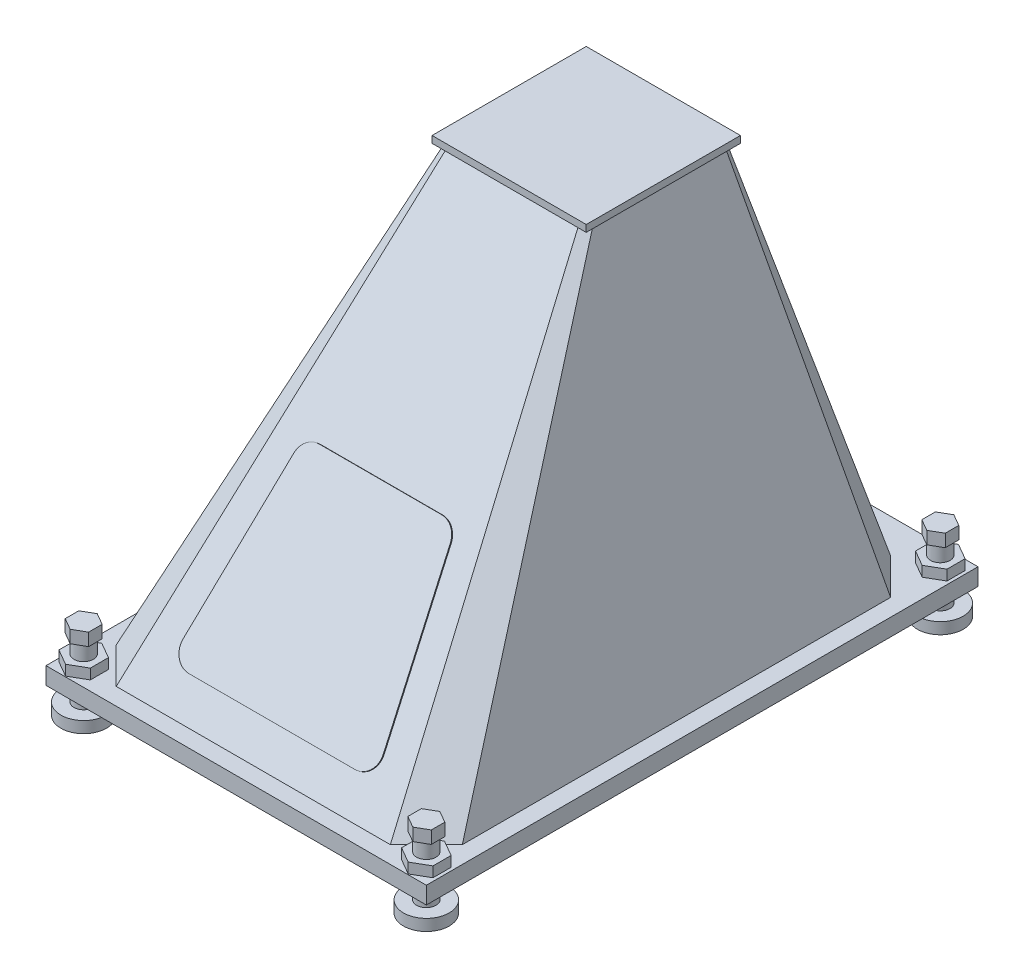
ISO-10303-21;
HEADER;
FILE_DESCRIPTION(('STEP AP214'),'2;1');
FILE_NAME('part.step','',(''),(''),'','','');
FILE_SCHEMA(('AUTOMOTIVE_DESIGN { 1 0 10303 214 1 1 1 1 }'));
ENDSEC;
DATA;
#1=APPLICATION_CONTEXT('core data for automotive mechanical design processes');
#2=APPLICATION_PROTOCOL_DEFINITION('international standard','automotive_design',2000,#1);
#3=PRODUCT_CONTEXT('',#1,'mechanical');
#4=PRODUCT('Part','Part','',(#3));
#5=PRODUCT_RELATED_PRODUCT_CATEGORY('part','',(#4));
#6=PRODUCT_DEFINITION_FORMATION('','',#4);
#7=PRODUCT_DEFINITION_CONTEXT('part definition',#1,'design');
#8=PRODUCT_DEFINITION('design','',#6,#7);
#9=PRODUCT_DEFINITION_SHAPE('','',#8);
#10=(LENGTH_UNIT() NAMED_UNIT(*) SI_UNIT(.MILLI.,.METRE.));
#11=(NAMED_UNIT(*) PLANE_ANGLE_UNIT() SI_UNIT($,.RADIAN.));
#12=(NAMED_UNIT(*) SI_UNIT($,.STERADIAN.) SOLID_ANGLE_UNIT());
#13=UNCERTAINTY_MEASURE_WITH_UNIT(LENGTH_MEASURE(1.E-05),#10,'distance_accuracy_value','');
#14=(GEOMETRIC_REPRESENTATION_CONTEXT(3) GLOBAL_UNCERTAINTY_ASSIGNED_CONTEXT((#13)) GLOBAL_UNIT_ASSIGNED_CONTEXT((#10,
#11,#12)) REPRESENTATION_CONTEXT('',''));
#15=CARTESIAN_POINT('',(0.,0.,0.));
#16=DIRECTION('',(0.,0.,1.));
#17=DIRECTION('',(1.,0.,0.));
#18=AXIS2_PLACEMENT_3D('',#15,#16,#17);
#19=CARTESIAN_POINT('',(0.,283.42874634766,406.144049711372));
#20=DIRECTION('',(0.,0.572279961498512,0.820058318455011));
#21=DIRECTION('',(0.,-0.820058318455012,0.572279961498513));
#22=AXIS2_PLACEMENT_3D('',#19,#20,#21);
#23=PLANE('',#22);
#24=DIRECTION('',(-0.154705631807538,-0.810185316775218,0.565390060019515));
#25=VECTOR('',#24,1.);
#26=CARTESIAN_POINT('',(-115.5,682.,128.));
#27=LINE('',#26,#25);
#28=CARTESIAN_POINT('',(-115.5,682.,128.));
#29=VERTEX_POINT('',#28);
#30=CARTESIAN_POINT('',(-240.,30.,583.));
#31=VERTEX_POINT('',#30);
#32=EDGE_CURVE('E1181',#29,#31,#27,.T.);
#33=ORIENTED_EDGE('',*,*,#32,.T.);
#34=DIRECTION('',(1.,0.,0.));
#35=VECTOR('',#34,1.);
#36=CARTESIAN_POINT('',(-240.,30.,583.));
#37=LINE('',#36,#35);
#38=CARTESIAN_POINT('',(240.,30.,583.));
#39=VERTEX_POINT('',#38);
#40=EDGE_CURVE('E1069',#31,#39,#37,.T.);
#41=ORIENTED_EDGE('',*,*,#40,.T.);
#42=DIRECTION('',(0.154705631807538,-0.810185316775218,0.565390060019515));
#43=VECTOR('',#42,1.);
#44=CARTESIAN_POINT('',(115.5,682.,128.));
#45=LINE('',#44,#43);
#46=CARTESIAN_POINT('',(115.5,682.,128.));
#47=VERTEX_POINT('',#46);
#48=EDGE_CURVE('E1629',#47,#39,#45,.T.);
#49=ORIENTED_EDGE('',*,*,#48,.F.);
#50=DIRECTION('',(1.,0.,0.));
#51=VECTOR('',#50,1.);
#52=CARTESIAN_POINT('',(115.5,682.,128.));
#53=LINE('',#52,#51);
#54=EDGE_CURVE('E1013',#29,#47,#53,.T.);
#55=ORIENTED_EDGE('',*,*,#54,.F.);
#56=EDGE_LOOP('',(#33,#41,#49,#55));
#57=FACE_BOUND('',#56,.T.);
#58=DIRECTION('',(-0.139173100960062,0.812077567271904,-0.566710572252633));
#59=VECTOR('',#58,1.);
#60=CARTESIAN_POINT('',(175.196989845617,107.229150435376,529.105424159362));
#61=LINE('',#60,#59);
#62=CARTESIAN_POINT('',(175.196989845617,107.229150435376,529.105424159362));
#63=VERTEX_POINT('',#62);
#64=CARTESIAN_POINT('',(136.969882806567,330.285013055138,373.445274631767));
#65=VERTEX_POINT('',#64);
#66=EDGE_CURVE('E1184',#63,#65,#61,.T.);
#67=ORIENTED_EDGE('',*,*,#66,.F.);
#68=CARTESIAN_POINT('',(145.48894778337,103.805248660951,531.494803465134));
#69=DIRECTION('',(0.,0.572279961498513,0.820058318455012));
#70=DIRECTION('',(0.,-0.820058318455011,0.572279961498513));
#71=AXIS2_PLACEMENT_3D('',#68,#69,#70);
#72=CIRCLE('',#71,30.);
#73=CARTESIAN_POINT('',(145.48894778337,79.2034991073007,548.663202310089));
#74=VERTEX_POINT('',#73);
#75=EDGE_CURVE('E529',#74,#63,#72,.T.);
#76=ORIENTED_EDGE('',*,*,#75,.F.);
#77=DIRECTION('',(1.,0.,0.));
#78=VECTOR('',#77,1.);
#79=CARTESIAN_POINT('',(-145.48894778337,79.2034991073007,548.663202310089));
#80=LINE('',#79,#78);
#81=CARTESIAN_POINT('',(-145.48894778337,79.2034991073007,548.663202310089));
#82=VERTEX_POINT('',#81);
#83=EDGE_CURVE('E525',#82,#74,#80,.T.);
#84=ORIENTED_EDGE('',*,*,#83,.F.);
#85=CARTESIAN_POINT('',(-145.48894778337,103.805248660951,531.494803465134));
#86=DIRECTION('',(0.,0.572279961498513,0.820058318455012));
#87=DIRECTION('',(0.,0.820058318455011,-0.572279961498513));
#88=AXIS2_PLACEMENT_3D('',#85,#86,#87);
#89=CIRCLE('',#88,30.);
#90=CARTESIAN_POINT('',(-175.196989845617,107.229150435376,529.105424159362));
#91=VERTEX_POINT('',#90);
#92=EDGE_CURVE('E1199',#91,#82,#89,.T.);
#93=ORIENTED_EDGE('',*,*,#92,.F.);
#94=DIRECTION('',(-0.139173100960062,-0.812077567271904,0.566710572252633));
#95=VECTOR('',#94,1.);
#96=CARTESIAN_POINT('',(-136.969882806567,330.285013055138,373.445274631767));
#97=LINE('',#96,#95);
#98=CARTESIAN_POINT('',(-136.969882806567,330.285013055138,373.445274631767));
#99=VERTEX_POINT('',#98);
#100=EDGE_CURVE('E1197',#99,#91,#97,.T.);
#101=ORIENTED_EDGE('',*,*,#100,.F.);
#102=CARTESIAN_POINT('',(-107.26184074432,326.861111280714,375.834653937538));
#103=DIRECTION('',(0.,0.572279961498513,0.820058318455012));
#104=DIRECTION('',(0.,-0.820058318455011,0.572279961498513));
#105=AXIS2_PLACEMENT_3D('',#102,#103,#104);
#106=CIRCLE('',#105,30.);
#107=CARTESIAN_POINT('',(-107.26184074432,351.462860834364,358.666255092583));
#108=VERTEX_POINT('',#107);
#109=EDGE_CURVE('E1195',#108,#99,#106,.T.);
#110=ORIENTED_EDGE('',*,*,#109,.F.);
#111=DIRECTION('',(-1.,0.,0.));
#112=VECTOR('',#111,1.);
#113=CARTESIAN_POINT('',(107.26184074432,351.462860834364,358.666255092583));
#114=LINE('',#113,#112);
#115=CARTESIAN_POINT('',(107.26184074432,351.462860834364,358.666255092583));
#116=VERTEX_POINT('',#115);
#117=EDGE_CURVE('E1189',#116,#108,#114,.T.);
#118=ORIENTED_EDGE('',*,*,#117,.F.);
#119=CARTESIAN_POINT('',(107.26184074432,326.861111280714,375.834653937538));
#120=DIRECTION('',(0.,0.572279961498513,0.820058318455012));
#121=DIRECTION('',(0.,-0.820058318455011,0.572279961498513));
#122=AXIS2_PLACEMENT_3D('',#119,#120,#121);
#123=CIRCLE('',#122,30.);
#124=EDGE_CURVE('E1187',#65,#116,#123,.T.);
#125=ORIENTED_EDGE('',*,*,#124,.F.);
#126=EDGE_LOOP('',(#67,#76,#84,#93,#101,#110,#118,#125));
#127=FACE_BOUND('',#126,.T.);
#128=ADVANCED_FACE('F54',(#57,#127),#23,.T.);
#129=CARTESIAN_POINT('',(-333.,30.,613.));
#130=DIRECTION('',(0.,1.,0.));
#131=DIRECTION('',(0.,0.,1.));
#132=AXIS2_PLACEMENT_3D('',#129,#130,#131);
#133=PLANE('',#132);
#134=DIRECTION('',(0.866025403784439,0.,-0.499999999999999));
#135=VECTOR('',#134,1.);
#136=CARTESIAN_POINT('',(300.,30.,-288.24573519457));
#137=LINE('',#136,#135);
#138=CARTESIAN_POINT('',(300.,30.,-288.24573519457));
#139=VERTEX_POINT('',#138);
#140=CARTESIAN_POINT('',(327.5,30.,-304.122867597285));
#141=VERTEX_POINT('',#140);
#142=EDGE_CURVE('E619',#139,#141,#137,.T.);
#143=ORIENTED_EDGE('',*,*,#142,.F.);
#144=DIRECTION('',(0.866025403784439,0.,0.499999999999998));
#145=VECTOR('',#144,1.);
#146=CARTESIAN_POINT('',(272.5,30.,-304.122867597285));
#147=LINE('',#146,#145);
#148=CARTESIAN_POINT('',(272.5,30.,-304.122867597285));
#149=VERTEX_POINT('',#148);
#150=EDGE_CURVE('E601',#149,#139,#147,.T.);
#151=ORIENTED_EDGE('',*,*,#150,.F.);
#152=DIRECTION('',(0.,0.,1.));
#153=VECTOR('',#152,1.);
#154=CARTESIAN_POINT('',(272.5,30.,-335.877132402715));
#155=LINE('',#154,#153);
#156=CARTESIAN_POINT('',(272.5,30.,-335.877132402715));
#157=VERTEX_POINT('',#156);
#158=EDGE_CURVE('E606',#157,#149,#155,.T.);
#159=ORIENTED_EDGE('',*,*,#158,.F.);
#160=DIRECTION('',(-0.866025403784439,0.,0.5));
#161=VECTOR('',#160,1.);
#162=CARTESIAN_POINT('',(300.,30.,-351.754264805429));
#163=LINE('',#162,#161);
#164=CARTESIAN_POINT('',(300.,30.,-351.754264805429));
#165=VERTEX_POINT('',#164);
#166=EDGE_CURVE('E625',#165,#157,#163,.T.);
#167=ORIENTED_EDGE('',*,*,#166,.F.);
#168=DIRECTION('',(-0.866025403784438,0.,-0.5));
#169=VECTOR('',#168,1.);
#170=CARTESIAN_POINT('',(327.5,30.,-335.877132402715));
#171=LINE('',#170,#169);
#172=CARTESIAN_POINT('',(327.5,30.,-335.877132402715));
#173=VERTEX_POINT('',#172);
#174=EDGE_CURVE('E623',#173,#165,#171,.T.);
#175=ORIENTED_EDGE('',*,*,#174,.F.);
#176=DIRECTION('',(0.,0.,-1.));
#177=VECTOR('',#176,1.);
#178=CARTESIAN_POINT('',(327.5,30.,-304.122867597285));
#179=LINE('',#178,#177);
#180=EDGE_CURVE('E621',#141,#173,#179,.T.);
#181=ORIENTED_EDGE('',*,*,#180,.F.);
#182=EDGE_LOOP('',(#143,#151,#159,#167,#175,#181));
#183=FACE_BOUND('',#182,.T.);
#184=DIRECTION('',(0.86602540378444,0.,-0.499999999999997));
#185=VECTOR('',#184,1.);
#186=CARTESIAN_POINT('',(-300.,30.,611.754264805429));
#187=LINE('',#186,#185);
#188=CARTESIAN_POINT('',(-300.,30.,611.754264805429));
#189=VERTEX_POINT('',#188);
#190=CARTESIAN_POINT('',(-272.5,30.,595.877132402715));
#191=VERTEX_POINT('',#190);
#192=EDGE_CURVE('E705',#189,#191,#187,.T.);
#193=ORIENTED_EDGE('',*,*,#192,.F.);
#194=DIRECTION('',(0.866025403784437,0.,0.500000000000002));
#195=VECTOR('',#194,1.);
#196=CARTESIAN_POINT('',(-327.5,30.,595.877132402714));
#197=LINE('',#196,#195);
#198=CARTESIAN_POINT('',(-327.5,30.,595.877132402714));
#199=VERTEX_POINT('',#198);
#200=EDGE_CURVE('E687',#199,#189,#197,.T.);
#201=ORIENTED_EDGE('',*,*,#200,.F.);
#202=DIRECTION('',(0.,0.,1.));
#203=VECTOR('',#202,1.);
#204=CARTESIAN_POINT('',(-327.5,30.,564.122867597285));
#205=LINE('',#204,#203);
#206=CARTESIAN_POINT('',(-327.5,30.,564.122867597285));
#207=VERTEX_POINT('',#206);
#208=EDGE_CURVE('E692',#207,#199,#205,.T.);
#209=ORIENTED_EDGE('',*,*,#208,.F.);
#210=DIRECTION('',(-0.866025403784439,0.,0.5));
#211=VECTOR('',#210,1.);
#212=CARTESIAN_POINT('',(-300.,30.,548.24573519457));
#213=LINE('',#212,#211);
#214=CARTESIAN_POINT('',(-300.,30.,548.24573519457));
#215=VERTEX_POINT('',#214);
#216=EDGE_CURVE('E711',#215,#207,#213,.T.);
#217=ORIENTED_EDGE('',*,*,#216,.F.);
#218=DIRECTION('',(-0.866025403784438,0.,-0.500000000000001));
#219=VECTOR('',#218,1.);
#220=CARTESIAN_POINT('',(-272.5,30.,564.122867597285));
#221=LINE('',#220,#219);
#222=CARTESIAN_POINT('',(-272.5,30.,564.122867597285));
#223=VERTEX_POINT('',#222);
#224=EDGE_CURVE('E709',#223,#215,#221,.T.);
#225=ORIENTED_EDGE('',*,*,#224,.F.);
#226=DIRECTION('',(0.,0.,-1.));
#227=VECTOR('',#226,1.);
#228=CARTESIAN_POINT('',(-272.5,30.,595.877132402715));
#229=LINE('',#228,#227);
#230=EDGE_CURVE('E707',#191,#223,#229,.T.);
#231=ORIENTED_EDGE('',*,*,#230,.F.);
#232=EDGE_LOOP('',(#193,#201,#209,#217,#225,#231));
#233=FACE_BOUND('',#232,.T.);
#234=DIRECTION('',(0.,0.,1.));
#235=VECTOR('',#234,1.);
#236=CARTESIAN_POINT('',(-333.,30.,-353.));
#237=LINE('',#236,#235);
#238=CARTESIAN_POINT('',(-333.,30.,-353.));
#239=VERTEX_POINT('',#238);
#240=CARTESIAN_POINT('',(-333.,30.,613.));
#241=VERTEX_POINT('',#240);
#242=EDGE_CURVE('E1113',#239,#241,#237,.T.);
#243=ORIENTED_EDGE('',*,*,#242,.T.);
#244=DIRECTION('',(1.,0.,0.));
#245=VECTOR('',#244,1.);
#246=CARTESIAN_POINT('',(-333.,30.,613.));
#247=LINE('',#246,#245);
#248=CARTESIAN_POINT('',(333.,30.,613.));
#249=VERTEX_POINT('',#248);
#250=EDGE_CURVE('E1123',#241,#249,#247,.T.);
#251=ORIENTED_EDGE('',*,*,#250,.T.);
#252=DIRECTION('',(0.,0.,-1.));
#253=VECTOR('',#252,1.);
#254=CARTESIAN_POINT('',(333.,30.,-353.));
#255=LINE('',#254,#253);
#256=CARTESIAN_POINT('',(333.,30.,-353.));
#257=VERTEX_POINT('',#256);
#258=EDGE_CURVE('E1121',#249,#257,#255,.T.);
#259=ORIENTED_EDGE('',*,*,#258,.T.);
#260=DIRECTION('',(-1.,0.,0.));
#261=VECTOR('',#260,1.);
#262=CARTESIAN_POINT('',(-333.,30.,-353.));
#263=LINE('',#262,#261);
#264=EDGE_CURVE('E1110',#257,#239,#263,.T.);
#265=ORIENTED_EDGE('',*,*,#264,.T.);
#266=EDGE_LOOP('',(#243,#251,#259,#265));
#267=FACE_BOUND('',#266,.T.);
#268=DIRECTION('',(0.,0.,1.));
#269=VECTOR('',#268,1.);
#270=CARTESIAN_POINT('',(-303.,30.,-230.));
#271=LINE('',#270,#269);
#272=CARTESIAN_POINT('',(-303.,30.,-230.));
#273=VERTEX_POINT('',#272);
#274=CARTESIAN_POINT('',(-303.,30.,520.));
#275=VERTEX_POINT('',#274);
#276=EDGE_CURVE('E1070',#273,#275,#271,.T.);
#277=ORIENTED_EDGE('',*,*,#276,.F.);
#278=DIRECTION('',(-0.707106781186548,0.,0.707106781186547));
#279=VECTOR('',#278,1.);
#280=CARTESIAN_POINT('',(-240.,30.,-293.));
#281=LINE('',#280,#279);
#282=CARTESIAN_POINT('',(-240.,30.,-293.));
#283=VERTEX_POINT('',#282);
#284=EDGE_CURVE('E964',#283,#273,#281,.T.);
#285=ORIENTED_EDGE('',*,*,#284,.F.);
#286=DIRECTION('',(-1.,0.,0.));
#287=VECTOR('',#286,1.);
#288=CARTESIAN_POINT('',(-240.,30.,-293.));
#289=LINE('',#288,#287);
#290=CARTESIAN_POINT('',(240.,30.,-293.));
#291=VERTEX_POINT('',#290);
#292=EDGE_CURVE('E1085',#291,#283,#289,.T.);
#293=ORIENTED_EDGE('',*,*,#292,.F.);
#294=DIRECTION('',(-0.707106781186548,0.,-0.707106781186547));
#295=VECTOR('',#294,1.);
#296=CARTESIAN_POINT('',(240.,30.,-293.));
#297=LINE('',#296,#295);
#298=CARTESIAN_POINT('',(303.,30.,-230.));
#299=VERTEX_POINT('',#298);
#300=EDGE_CURVE('E1089',#299,#291,#297,.T.);
#301=ORIENTED_EDGE('',*,*,#300,.F.);
#302=DIRECTION('',(0.,0.,-1.));
#303=VECTOR('',#302,1.);
#304=CARTESIAN_POINT('',(303.,30.,-230.));
#305=LINE('',#304,#303);
#306=CARTESIAN_POINT('',(303.,30.,520.));
#307=VERTEX_POINT('',#306);
#308=EDGE_CURVE('E1078',#307,#299,#305,.T.);
#309=ORIENTED_EDGE('',*,*,#308,.F.);
#310=DIRECTION('',(0.707106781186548,0.,-0.707106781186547));
#311=VECTOR('',#310,1.);
#312=CARTESIAN_POINT('',(240.,30.,583.));
#313=LINE('',#312,#311);
#314=EDGE_CURVE('E1074',#39,#307,#313,.T.);
#315=ORIENTED_EDGE('',*,*,#314,.F.);
#316=ORIENTED_EDGE('',*,*,#40,.F.);
#317=DIRECTION('',(0.707106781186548,0.,0.707106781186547));
#318=VECTOR('',#317,1.);
#319=CARTESIAN_POINT('',(-303.,30.,520.));
#320=LINE('',#319,#318);
#321=EDGE_CURVE('E1067',#275,#31,#320,.T.);
#322=ORIENTED_EDGE('',*,*,#321,.F.);
#323=EDGE_LOOP('',(#277,#285,#293,#301,#309,#315,#316,#322));
#324=FACE_BOUND('',#323,.T.);
#325=DIRECTION('',(0.866025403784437,0.,-0.500000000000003));
#326=VECTOR('',#325,1.);
#327=CARTESIAN_POINT('',(300.,30.,611.75426480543));
#328=LINE('',#327,#326);
#329=CARTESIAN_POINT('',(300.,30.,611.75426480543));
#330=VERTEX_POINT('',#329);
#331=CARTESIAN_POINT('',(327.500000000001,30.,595.877132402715));
#332=VERTEX_POINT('',#331);
#333=EDGE_CURVE('E662',#330,#332,#328,.T.);
#334=ORIENTED_EDGE('',*,*,#333,.F.);
#335=DIRECTION('',(0.866025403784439,0.,0.5));
#336=VECTOR('',#335,1.);
#337=CARTESIAN_POINT('',(272.5,30.,595.877132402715));
#338=LINE('',#337,#336);
#339=CARTESIAN_POINT('',(272.5,30.,595.877132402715));
#340=VERTEX_POINT('',#339);
#341=EDGE_CURVE('E644',#340,#330,#338,.T.);
#342=ORIENTED_EDGE('',*,*,#341,.F.);
#343=DIRECTION('',(0.,0.,1.));
#344=VECTOR('',#343,1.);
#345=CARTESIAN_POINT('',(272.5,30.,564.122867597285));
#346=LINE('',#345,#344);
#347=CARTESIAN_POINT('',(272.5,30.,564.122867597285));
#348=VERTEX_POINT('',#347);
#349=EDGE_CURVE('E649',#348,#340,#346,.T.);
#350=ORIENTED_EDGE('',*,*,#349,.F.);
#351=DIRECTION('',(-0.866025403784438,0.,0.500000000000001));
#352=VECTOR('',#351,1.);
#353=CARTESIAN_POINT('',(300.,30.,548.24573519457));
#354=LINE('',#353,#352);
#355=CARTESIAN_POINT('',(300.,30.,548.24573519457));
#356=VERTEX_POINT('',#355);
#357=EDGE_CURVE('E668',#356,#348,#354,.T.);
#358=ORIENTED_EDGE('',*,*,#357,.F.);
#359=DIRECTION('',(-0.866025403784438,0.,-0.500000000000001));
#360=VECTOR('',#359,1.);
#361=CARTESIAN_POINT('',(327.500000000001,30.,564.122867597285));
#362=LINE('',#361,#360);
#363=CARTESIAN_POINT('',(327.500000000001,30.,564.122867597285));
#364=VERTEX_POINT('',#363);
#365=EDGE_CURVE('E666',#364,#356,#362,.T.);
#366=ORIENTED_EDGE('',*,*,#365,.F.);
#367=DIRECTION('',(0.,0.,-1.));
#368=VECTOR('',#367,1.);
#369=CARTESIAN_POINT('',(327.500000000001,30.,595.877132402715));
#370=LINE('',#369,#368);
#371=EDGE_CURVE('E664',#332,#364,#370,.T.);
#372=ORIENTED_EDGE('',*,*,#371,.F.);
#373=EDGE_LOOP('',(#334,#342,#350,#358,#366,#372));
#374=FACE_BOUND('',#373,.T.);
#375=DIRECTION('',(0.866025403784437,0.,-0.500000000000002));
#376=VECTOR('',#375,1.);
#377=CARTESIAN_POINT('',(-300.,30.,-288.24573519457));
#378=LINE('',#377,#376);
#379=CARTESIAN_POINT('',(-300.,30.,-288.24573519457));
#380=VERTEX_POINT('',#379);
#381=CARTESIAN_POINT('',(-272.5,30.,-304.122867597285));
#382=VERTEX_POINT('',#381);
#383=EDGE_CURVE('E578',#380,#382,#378,.T.);
#384=ORIENTED_EDGE('',*,*,#383,.F.);
#385=DIRECTION('',(0.866025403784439,0.,0.5));
#386=VECTOR('',#385,1.);
#387=CARTESIAN_POINT('',(-327.5,30.,-304.122867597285));
#388=LINE('',#387,#386);
#389=CARTESIAN_POINT('',(-327.5,30.,-304.122867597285));
#390=VERTEX_POINT('',#389);
#391=EDGE_CURVE('E560',#390,#380,#388,.T.);
#392=ORIENTED_EDGE('',*,*,#391,.F.);
#393=DIRECTION('',(0.,0.,1.));
#394=VECTOR('',#393,1.);
#395=CARTESIAN_POINT('',(-327.5,30.,-335.877132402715));
#396=LINE('',#395,#394);
#397=CARTESIAN_POINT('',(-327.5,30.,-335.877132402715));
#398=VERTEX_POINT('',#397);
#399=EDGE_CURVE('E565',#398,#390,#396,.T.);
#400=ORIENTED_EDGE('',*,*,#399,.F.);
#401=DIRECTION('',(-0.866025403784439,0.,0.499999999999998));
#402=VECTOR('',#401,1.);
#403=CARTESIAN_POINT('',(-300.,30.,-351.754264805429));
#404=LINE('',#403,#402);
#405=CARTESIAN_POINT('',(-300.,30.,-351.754264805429));
#406=VERTEX_POINT('',#405);
#407=EDGE_CURVE('E584',#406,#398,#404,.T.);
#408=ORIENTED_EDGE('',*,*,#407,.F.);
#409=DIRECTION('',(-0.86602540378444,0.,-0.499999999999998));
#410=VECTOR('',#409,1.);
#411=CARTESIAN_POINT('',(-272.5,30.,-335.877132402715));
#412=LINE('',#411,#410);
#413=CARTESIAN_POINT('',(-272.5,30.,-335.877132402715));
#414=VERTEX_POINT('',#413);
#415=EDGE_CURVE('E582',#414,#406,#412,.T.);
#416=ORIENTED_EDGE('',*,*,#415,.F.);
#417=DIRECTION('',(0.,0.,-1.));
#418=VECTOR('',#417,1.);
#419=CARTESIAN_POINT('',(-272.5,30.,-304.122867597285));
#420=LINE('',#419,#418);
#421=EDGE_CURVE('E580',#382,#414,#420,.T.);
#422=ORIENTED_EDGE('',*,*,#421,.F.);
#423=EDGE_LOOP('',(#384,#392,#400,#408,#416,#422));
#424=FACE_BOUND('',#423,.T.);
#425=ADVANCED_FACE('F1151',(#183,#233,#267,#324,#374,#424),#133,.T.);
#426=CARTESIAN_POINT('',(-333.,30.,-353.));
#427=DIRECTION('',(1.,0.,0.));
#428=DIRECTION('',(0.,0.,-1.));
#429=AXIS2_PLACEMENT_3D('',#426,#427,#428);
#430=PLANE('',#429);
#431=DIRECTION('',(0.,0.,1.));
#432=VECTOR('',#431,1.);
#433=CARTESIAN_POINT('',(-333.,0.,-353.));
#434=LINE('',#433,#432);
#435=CARTESIAN_POINT('',(-333.,0.,-353.));
#436=VERTEX_POINT('',#435);
#437=CARTESIAN_POINT('',(-333.,0.,613.));
#438=VERTEX_POINT('',#437);
#439=EDGE_CURVE('E1064',#436,#438,#434,.T.);
#440=ORIENTED_EDGE('',*,*,#439,.T.);
#441=DIRECTION('',(0.,-1.,0.));
#442=VECTOR('',#441,1.);
#443=CARTESIAN_POINT('',(-333.,30.,613.));
#444=LINE('',#443,#442);
#445=EDGE_CURVE('E1037',#241,#438,#444,.T.);
#446=ORIENTED_EDGE('',*,*,#445,.F.);
#447=ORIENTED_EDGE('',*,*,#242,.F.);
#448=DIRECTION('',(0.,-1.,0.));
#449=VECTOR('',#448,1.);
#450=CARTESIAN_POINT('',(-333.,30.,-353.));
#451=LINE('',#450,#449);
#452=EDGE_CURVE('E1107',#239,#436,#451,.T.);
#453=ORIENTED_EDGE('',*,*,#452,.T.);
#454=EDGE_LOOP('',(#440,#446,#447,#453));
#455=FACE_BOUND('',#454,.T.);
#456=ADVANCED_FACE('F56',(#455),#430,.F.);
#457=CARTESIAN_POINT('',(-333.,30.,613.));
#458=DIRECTION('',(0.,0.,-1.));
#459=DIRECTION('',(-1.,0.,0.));
#460=AXIS2_PLACEMENT_3D('',#457,#458,#459);
#461=PLANE('',#460);
#462=DIRECTION('',(1.,0.,0.));
#463=VECTOR('',#462,1.);
#464=CARTESIAN_POINT('',(-333.,0.,613.));
#465=LINE('',#464,#463);
#466=CARTESIAN_POINT('',(333.,0.,613.));
#467=VERTEX_POINT('',#466);
#468=EDGE_CURVE('E1116',#438,#467,#465,.T.);
#469=ORIENTED_EDGE('',*,*,#468,.T.);
#470=DIRECTION('',(0.,-1.,0.));
#471=VECTOR('',#470,1.);
#472=CARTESIAN_POINT('',(333.,30.,613.));
#473=LINE('',#472,#471);
#474=EDGE_CURVE('E1101',#249,#467,#473,.T.);
#475=ORIENTED_EDGE('',*,*,#474,.F.);
#476=ORIENTED_EDGE('',*,*,#250,.F.);
#477=ORIENTED_EDGE('',*,*,#445,.T.);
#478=EDGE_LOOP('',(#469,#475,#476,#477));
#479=FACE_BOUND('',#478,.T.);
#480=ADVANCED_FACE('F1166',(#479),#461,.F.);
#481=CARTESIAN_POINT('',(333.,30.,-353.));
#482=DIRECTION('',(-1.,0.,0.));
#483=DIRECTION('',(0.,0.,1.));
#484=AXIS2_PLACEMENT_3D('',#481,#482,#483);
#485=PLANE('',#484);
#486=DIRECTION('',(0.,0.,-1.));
#487=VECTOR('',#486,1.);
#488=CARTESIAN_POINT('',(333.,0.,-353.));
#489=LINE('',#488,#487);
#490=CARTESIAN_POINT('',(333.,0.,-353.));
#491=VERTEX_POINT('',#490);
#492=EDGE_CURVE('E1114',#467,#491,#489,.T.);
#493=ORIENTED_EDGE('',*,*,#492,.T.);
#494=DIRECTION('',(0.,-1.,0.));
#495=VECTOR('',#494,1.);
#496=CARTESIAN_POINT('',(333.,30.,-353.));
#497=LINE('',#496,#495);
#498=EDGE_CURVE('E1104',#257,#491,#497,.T.);
#499=ORIENTED_EDGE('',*,*,#498,.F.);
#500=ORIENTED_EDGE('',*,*,#258,.F.);
#501=ORIENTED_EDGE('',*,*,#474,.T.);
#502=EDGE_LOOP('',(#493,#499,#500,#501));
#503=FACE_BOUND('',#502,.T.);
#504=ADVANCED_FACE('F1163',(#503),#485,.F.);
#505=CARTESIAN_POINT('',(-333.,30.,-353.));
#506=DIRECTION('',(0.,0.,1.));
#507=DIRECTION('',(1.,0.,0.));
#508=AXIS2_PLACEMENT_3D('',#505,#506,#507);
#509=PLANE('',#508);
#510=DIRECTION('',(-1.,0.,0.));
#511=VECTOR('',#510,1.);
#512=CARTESIAN_POINT('',(-333.,0.,-353.));
#513=LINE('',#512,#511);
#514=EDGE_CURVE('E1111',#491,#436,#513,.T.);
#515=ORIENTED_EDGE('',*,*,#514,.T.);
#516=ORIENTED_EDGE('',*,*,#452,.F.);
#517=ORIENTED_EDGE('',*,*,#264,.F.);
#518=ORIENTED_EDGE('',*,*,#498,.T.);
#519=EDGE_LOOP('',(#515,#516,#517,#518));
#520=FACE_BOUND('',#519,.T.);
#521=ADVANCED_FACE('F1159',(#520),#509,.F.);
#522=CARTESIAN_POINT('',(-333.,0.,613.));
#523=DIRECTION('',(0.,1.,0.));
#524=DIRECTION('',(0.,0.,1.));
#525=AXIS2_PLACEMENT_3D('',#522,#523,#524);
#526=PLANE('',#525);
#527=CARTESIAN_POINT('',(-300.,0.,-320.));
#528=DIRECTION('',(0.,1.,0.));
#529=DIRECTION('',(0.,0.,1.));
#530=AXIS2_PLACEMENT_3D('',#527,#528,#529);
#531=CIRCLE('',#530,17.);
#532=CARTESIAN_POINT('',(-300.,0.,-303.));
#533=VERTEX_POINT('',#532);
#534=EDGE_CURVE('E921',#533,#533,#531,.T.);
#535=ORIENTED_EDGE('',*,*,#534,.T.);
#536=EDGE_LOOP('',(#535));
#537=FACE_BOUND('',#536,.T.);
#538=CARTESIAN_POINT('',(300.,0.,-320.));
#539=DIRECTION('',(0.,1.,0.));
#540=DIRECTION('',(0.,0.,1.));
#541=AXIS2_PLACEMENT_3D('',#538,#539,#540);
#542=CIRCLE('',#541,17.);
#543=CARTESIAN_POINT('',(300.,0.,-303.));
#544=VERTEX_POINT('',#543);
#545=EDGE_CURVE('E925',#544,#544,#542,.T.);
#546=ORIENTED_EDGE('',*,*,#545,.T.);
#547=EDGE_LOOP('',(#546));
#548=FACE_BOUND('',#547,.T.);
#549=CARTESIAN_POINT('',(300.,0.,580.));
#550=DIRECTION('',(0.,1.,0.));
#551=DIRECTION('',(0.,0.,1.));
#552=AXIS2_PLACEMENT_3D('',#549,#550,#551);
#553=CIRCLE('',#552,17.);
#554=CARTESIAN_POINT('',(300.,0.,597.));
#555=VERTEX_POINT('',#554);
#556=EDGE_CURVE('E929',#555,#555,#553,.T.);
#557=ORIENTED_EDGE('',*,*,#556,.T.);
#558=EDGE_LOOP('',(#557));
#559=FACE_BOUND('',#558,.T.);
#560=CARTESIAN_POINT('',(-300.,0.,580.));
#561=DIRECTION('',(0.,1.,0.));
#562=DIRECTION('',(0.,0.,1.));
#563=AXIS2_PLACEMENT_3D('',#560,#561,#562);
#564=CIRCLE('',#563,17.);
#565=CARTESIAN_POINT('',(-300.,0.,597.));
#566=VERTEX_POINT('',#565);
#567=EDGE_CURVE('E933',#566,#566,#564,.T.);
#568=ORIENTED_EDGE('',*,*,#567,.T.);
#569=EDGE_LOOP('',(#568));
#570=FACE_BOUND('',#569,.T.);
#571=ORIENTED_EDGE('',*,*,#439,.F.);
#572=ORIENTED_EDGE('',*,*,#514,.F.);
#573=ORIENTED_EDGE('',*,*,#492,.F.);
#574=ORIENTED_EDGE('',*,*,#468,.F.);
#575=EDGE_LOOP('',(#571,#572,#573,#574));
#576=FACE_BOUND('',#575,.T.);
#577=ADVANCED_FACE('F1155',(#537,#548,#559,#570,#576),#526,.F.);
#578=CARTESIAN_POINT('',(0.,71.4915249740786,-282.499844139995));
#579=DIRECTION('',(0.,0.245333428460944,-0.96943875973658));
#580=DIRECTION('',(0.,0.96943875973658,0.245333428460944));
#581=AXIS2_PLACEMENT_3D('',#578,#579,#580);
#582=PLANE('',#581);
#583=DIRECTION('',(0.182022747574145,-0.95324362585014,-0.241234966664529));
#584=VECTOR('',#583,1.);
#585=CARTESIAN_POINT('',(115.5,682.,-128.));
#586=LINE('',#585,#584);
#587=CARTESIAN_POINT('',(115.5,682.,-128.));
#588=VERTEX_POINT('',#587);
#589=EDGE_CURVE('E1637',#588,#291,#586,.T.);
#590=ORIENTED_EDGE('',*,*,#589,.T.);
#591=ORIENTED_EDGE('',*,*,#292,.T.);
#592=DIRECTION('',(-0.182022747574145,-0.95324362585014,-0.241234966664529));
#593=VECTOR('',#592,1.);
#594=CARTESIAN_POINT('',(-115.5,682.,-128.));
#595=LINE('',#594,#593);
#596=CARTESIAN_POINT('',(-115.5,682.,-128.));
#597=VERTEX_POINT('',#596);
#598=EDGE_CURVE('E1055',#597,#283,#595,.T.);
#599=ORIENTED_EDGE('',*,*,#598,.F.);
#600=DIRECTION('',(-1.,0.,0.));
#601=VECTOR('',#600,1.);
#602=CARTESIAN_POINT('',(-115.5,682.,-128.));
#603=LINE('',#602,#601);
#604=EDGE_CURVE('E1048',#588,#597,#603,.T.);
#605=ORIENTED_EDGE('',*,*,#604,.F.);
#606=EDGE_LOOP('',(#590,#591,#599,#605));
#607=FACE_BOUND('',#606,.T.);
#608=ADVANCED_FACE('F1158',(#607),#582,.T.);
#609=CARTESIAN_POINT('',(-248.649372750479,110.404897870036,-248.649372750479));
#610=DIRECTION('',(-0.674636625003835,0.299551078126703,-0.674636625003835));
#611=DIRECTION('',(-0.707106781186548,0.,0.707106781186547));
#612=AXIS2_PLACEMENT_3D('',#609,#610,#611);
#613=PLANE('',#612);
#614=ORIENTED_EDGE('',*,*,#598,.T.);
#615=ORIENTED_EDGE('',*,*,#284,.T.);
#616=DIRECTION('',(-0.25557953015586,-0.952216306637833,-0.167222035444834));
#617=VECTOR('',#616,1.);
#618=CARTESIAN_POINT('',(-128.,682.,-115.5));
#619=LINE('',#618,#617);
#620=CARTESIAN_POINT('',(-128.,682.,-115.5));
#621=VERTEX_POINT('',#620);
#622=EDGE_CURVE('E1088',#621,#273,#619,.T.);
#623=ORIENTED_EDGE('',*,*,#622,.F.);
#624=DIRECTION('',(-0.707106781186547,0.,0.707106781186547));
#625=VECTOR('',#624,1.);
#626=CARTESIAN_POINT('',(-128.,682.,-115.5));
#627=LINE('',#626,#625);
#628=EDGE_CURVE('E1050',#597,#621,#627,.T.);
#629=ORIENTED_EDGE('',*,*,#628,.F.);
#630=EDGE_LOOP('',(#614,#615,#623,#629));
#631=FACE_BOUND('',#630,.T.);
#632=ADVANCED_FACE('F1673',(#631),#613,.T.);
#633=CARTESIAN_POINT('',(248.649372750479,110.404897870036,-248.649372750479));
#634=DIRECTION('',(0.674636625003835,0.299551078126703,-0.674636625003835));
#635=DIRECTION('',(-0.707106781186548,0.,-0.707106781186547));
#636=AXIS2_PLACEMENT_3D('',#633,#634,#635);
#637=PLANE('',#636);
#638=DIRECTION('',(0.25557953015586,-0.952216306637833,-0.167222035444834));
#639=VECTOR('',#638,1.);
#640=CARTESIAN_POINT('',(128.,682.,-115.5));
#641=LINE('',#640,#639);
#642=CARTESIAN_POINT('',(128.,682.,-115.5));
#643=VERTEX_POINT('',#642);
#644=EDGE_CURVE('E1642',#643,#299,#641,.T.);
#645=ORIENTED_EDGE('',*,*,#644,.T.);
#646=ORIENTED_EDGE('',*,*,#300,.T.);
#647=ORIENTED_EDGE('',*,*,#589,.F.);
#648=DIRECTION('',(-0.707106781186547,0.,-0.707106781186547));
#649=VECTOR('',#648,1.);
#650=CARTESIAN_POINT('',(115.5,682.,-128.));
#651=LINE('',#650,#649);
#652=EDGE_CURVE('E1020',#643,#588,#651,.T.);
#653=ORIENTED_EDGE('',*,*,#652,.F.);
#654=EDGE_LOOP('',(#645,#646,#647,#653));
#655=FACE_BOUND('',#654,.T.);
#656=ADVANCED_FACE('F1669',(#655),#637,.T.);
#657=CARTESIAN_POINT('',(290.149435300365,77.8775324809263,0.));
#658=DIRECTION('',(0.965815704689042,0.259229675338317,0.));
#659=DIRECTION('',(-0.259229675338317,0.965815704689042,0.));
#660=AXIS2_PLACEMENT_3D('',#657,#658,#659);
#661=PLANE('',#660);
#662=DIRECTION('',(0.222366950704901,-0.828475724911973,0.513985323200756));
#663=VECTOR('',#662,1.);
#664=CARTESIAN_POINT('',(128.,682.,115.5));
#665=LINE('',#664,#663);
#666=CARTESIAN_POINT('',(128.,682.,115.5));
#667=VERTEX_POINT('',#666);
#668=EDGE_CURVE('E1647',#667,#307,#665,.T.);
#669=ORIENTED_EDGE('',*,*,#668,.T.);
#670=ORIENTED_EDGE('',*,*,#308,.T.);
#671=ORIENTED_EDGE('',*,*,#644,.F.);
#672=DIRECTION('',(0.,0.,-1.));
#673=VECTOR('',#672,1.);
#674=CARTESIAN_POINT('',(128.,682.,-115.5));
#675=LINE('',#674,#673);
#676=EDGE_CURVE('E1012',#667,#643,#675,.T.);
#677=ORIENTED_EDGE('',*,*,#676,.F.);
#678=EDGE_LOOP('',(#669,#670,#671,#677));
#679=FACE_BOUND('',#678,.T.);
#680=ADVANCED_FACE('F1666',(#679),#661,.T.);
#681=CARTESIAN_POINT('',(304.542165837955,270.678198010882,304.542165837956));
#682=DIRECTION('',(0.598687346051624,0.532115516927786,0.598687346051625));
#683=DIRECTION('',(0.707106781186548,0.,-0.707106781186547));
#684=AXIS2_PLACEMENT_3D('',#681,#682,#683);
#685=PLANE('',#684);
#686=ORIENTED_EDGE('',*,*,#48,.T.);
#687=ORIENTED_EDGE('',*,*,#314,.T.);
#688=ORIENTED_EDGE('',*,*,#668,.F.);
#689=DIRECTION('',(0.707106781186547,0.,-0.707106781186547));
#690=VECTOR('',#689,1.);
#691=CARTESIAN_POINT('',(128.,682.,115.5));
#692=LINE('',#691,#690);
#693=EDGE_CURVE('E1008',#47,#667,#692,.T.);
#694=ORIENTED_EDGE('',*,*,#693,.F.);
#695=EDGE_LOOP('',(#686,#687,#688,#694));
#696=FACE_BOUND('',#695,.T.);
#697=ADVANCED_FACE('F1143',(#696),#685,.T.);
#698=CARTESIAN_POINT('',(-304.542165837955,270.678198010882,304.542165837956));
#699=DIRECTION('',(-0.598687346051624,0.532115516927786,0.598687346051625));
#700=DIRECTION('',(0.707106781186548,0.,0.707106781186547));
#701=AXIS2_PLACEMENT_3D('',#698,#699,#700);
#702=PLANE('',#701);
#703=DIRECTION('',(-0.222366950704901,-0.828475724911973,0.513985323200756));
#704=VECTOR('',#703,1.);
#705=CARTESIAN_POINT('',(-128.,682.,115.5));
#706=LINE('',#705,#704);
#707=CARTESIAN_POINT('',(-128.,682.,115.5));
#708=VERTEX_POINT('',#707);
#709=EDGE_CURVE('E1627',#708,#275,#706,.T.);
#710=ORIENTED_EDGE('',*,*,#709,.T.);
#711=ORIENTED_EDGE('',*,*,#321,.T.);
#712=ORIENTED_EDGE('',*,*,#32,.F.);
#713=DIRECTION('',(0.707106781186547,0.,0.707106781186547));
#714=VECTOR('',#713,1.);
#715=CARTESIAN_POINT('',(-115.5,682.,128.));
#716=LINE('',#715,#714);
#717=EDGE_CURVE('E971',#708,#29,#716,.T.);
#718=ORIENTED_EDGE('',*,*,#717,.F.);
#719=EDGE_LOOP('',(#710,#711,#712,#718));
#720=FACE_BOUND('',#719,.T.);
#721=ADVANCED_FACE('F1132',(#720),#702,.T.);
#722=CARTESIAN_POINT('',(-290.149435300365,77.8775324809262,0.));
#723=DIRECTION('',(-0.965815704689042,0.259229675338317,0.));
#724=DIRECTION('',(-0.259229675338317,-0.965815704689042,0.));
#725=AXIS2_PLACEMENT_3D('',#722,#723,#724);
#726=PLANE('',#725);
#727=ORIENTED_EDGE('',*,*,#622,.T.);
#728=ORIENTED_EDGE('',*,*,#276,.T.);
#729=ORIENTED_EDGE('',*,*,#709,.F.);
#730=DIRECTION('',(0.,0.,1.));
#731=VECTOR('',#730,1.);
#732=CARTESIAN_POINT('',(-128.,682.,115.5));
#733=LINE('',#732,#731);
#734=EDGE_CURVE('E1027',#621,#708,#733,.T.);
#735=ORIENTED_EDGE('',*,*,#734,.F.);
#736=EDGE_LOOP('',(#727,#728,#729,#735));
#737=FACE_BOUND('',#736,.T.);
#738=ADVANCED_FACE('F1142',(#737),#726,.T.);
#739=CARTESIAN_POINT('',(-135.,694.,135.));
#740=DIRECTION('',(1.,0.,0.));
#741=DIRECTION('',(0.,0.,-1.));
#742=AXIS2_PLACEMENT_3D('',#739,#740,#741);
#743=PLANE('',#742);
#744=DIRECTION('',(0.,0.,1.));
#745=VECTOR('',#744,1.);
#746=CARTESIAN_POINT('',(-135.,682.,135.));
#747=LINE('',#746,#745);
#748=CARTESIAN_POINT('',(-135.,682.,-135.));
#749=VERTEX_POINT('',#748);
#750=CARTESIAN_POINT('',(-135.,682.,135.));
#751=VERTEX_POINT('',#750);
#752=EDGE_CURVE('E945',#749,#751,#747,.T.);
#753=ORIENTED_EDGE('',*,*,#752,.T.);
#754=DIRECTION('',(0.,-1.,0.));
#755=VECTOR('',#754,1.);
#756=CARTESIAN_POINT('',(-135.,694.,135.));
#757=LINE('',#756,#755);
#758=CARTESIAN_POINT('',(-135.,694.,135.));
#759=VERTEX_POINT('',#758);
#760=EDGE_CURVE('E961',#759,#751,#757,.T.);
#761=ORIENTED_EDGE('',*,*,#760,.F.);
#762=DIRECTION('',(0.,0.,1.));
#763=VECTOR('',#762,1.);
#764=CARTESIAN_POINT('',(-135.,694.,135.));
#765=LINE('',#764,#763);
#766=CARTESIAN_POINT('',(-135.,694.,-135.));
#767=VERTEX_POINT('',#766);
#768=EDGE_CURVE('E934',#767,#759,#765,.T.);
#769=ORIENTED_EDGE('',*,*,#768,.F.);
#770=DIRECTION('',(0.,-1.,0.));
#771=VECTOR('',#770,1.);
#772=CARTESIAN_POINT('',(-135.,694.,-135.));
#773=LINE('',#772,#771);
#774=EDGE_CURVE('E944',#767,#749,#773,.T.);
#775=ORIENTED_EDGE('',*,*,#774,.T.);
#776=EDGE_LOOP('',(#753,#761,#769,#775));
#777=FACE_BOUND('',#776,.T.);
#778=ADVANCED_FACE('F1149',(#777),#743,.F.);
#779=CARTESIAN_POINT('',(135.,694.,135.));
#780=DIRECTION('',(0.,0.,-1.));
#781=DIRECTION('',(-1.,0.,0.));
#782=AXIS2_PLACEMENT_3D('',#779,#780,#781);
#783=PLANE('',#782);
#784=DIRECTION('',(1.,0.,0.));
#785=VECTOR('',#784,1.);
#786=CARTESIAN_POINT('',(135.,682.,135.));
#787=LINE('',#786,#785);
#788=CARTESIAN_POINT('',(135.,682.,135.));
#789=VERTEX_POINT('',#788);
#790=EDGE_CURVE('E948',#751,#789,#787,.T.);
#791=ORIENTED_EDGE('',*,*,#790,.T.);
#792=DIRECTION('',(0.,-1.,0.));
#793=VECTOR('',#792,1.);
#794=CARTESIAN_POINT('',(135.,694.,135.));
#795=LINE('',#794,#793);
#796=CARTESIAN_POINT('',(135.,694.,135.));
#797=VERTEX_POINT('',#796);
#798=EDGE_CURVE('E958',#797,#789,#795,.T.);
#799=ORIENTED_EDGE('',*,*,#798,.F.);
#800=DIRECTION('',(1.,0.,0.));
#801=VECTOR('',#800,1.);
#802=CARTESIAN_POINT('',(135.,694.,135.));
#803=LINE('',#802,#801);
#804=EDGE_CURVE('E937',#759,#797,#803,.T.);
#805=ORIENTED_EDGE('',*,*,#804,.F.);
#806=ORIENTED_EDGE('',*,*,#760,.T.);
#807=EDGE_LOOP('',(#791,#799,#805,#806));
#808=FACE_BOUND('',#807,.T.);
#809=ADVANCED_FACE('F1683',(#808),#783,.F.);
#810=CARTESIAN_POINT('',(135.,694.,135.));
#811=DIRECTION('',(-1.,0.,0.));
#812=DIRECTION('',(0.,0.,1.));
#813=AXIS2_PLACEMENT_3D('',#810,#811,#812);
#814=PLANE('',#813);
#815=DIRECTION('',(0.,0.,-1.));
#816=VECTOR('',#815,1.);
#817=CARTESIAN_POINT('',(135.,682.,135.));
#818=LINE('',#817,#816);
#819=CARTESIAN_POINT('',(135.,682.,-135.));
#820=VERTEX_POINT('',#819);
#821=EDGE_CURVE('E950',#789,#820,#818,.T.);
#822=ORIENTED_EDGE('',*,*,#821,.T.);
#823=DIRECTION('',(0.,-1.,0.));
#824=VECTOR('',#823,1.);
#825=CARTESIAN_POINT('',(135.,694.,-135.));
#826=LINE('',#825,#824);
#827=CARTESIAN_POINT('',(135.,694.,-135.));
#828=VERTEX_POINT('',#827);
#829=EDGE_CURVE('E955',#828,#820,#826,.T.);
#830=ORIENTED_EDGE('',*,*,#829,.F.);
#831=DIRECTION('',(0.,0.,-1.));
#832=VECTOR('',#831,1.);
#833=CARTESIAN_POINT('',(135.,694.,135.));
#834=LINE('',#833,#832);
#835=EDGE_CURVE('E940',#797,#828,#834,.T.);
#836=ORIENTED_EDGE('',*,*,#835,.F.);
#837=ORIENTED_EDGE('',*,*,#798,.T.);
#838=EDGE_LOOP('',(#822,#830,#836,#837));
#839=FACE_BOUND('',#838,.T.);
#840=ADVANCED_FACE('F1686',(#839),#814,.F.);
#841=CARTESIAN_POINT('',(135.,694.,-135.));
#842=DIRECTION('',(0.,0.,1.));
#843=DIRECTION('',(1.,0.,0.));
#844=AXIS2_PLACEMENT_3D('',#841,#842,#843);
#845=PLANE('',#844);
#846=DIRECTION('',(-1.,0.,0.));
#847=VECTOR('',#846,1.);
#848=CARTESIAN_POINT('',(135.,682.,-135.));
#849=LINE('',#848,#847);
#850=EDGE_CURVE('E938',#820,#749,#849,.T.);
#851=ORIENTED_EDGE('',*,*,#850,.T.);
#852=ORIENTED_EDGE('',*,*,#774,.F.);
#853=DIRECTION('',(-1.,0.,0.));
#854=VECTOR('',#853,1.);
#855=CARTESIAN_POINT('',(135.,694.,-135.));
#856=LINE('',#855,#854);
#857=EDGE_CURVE('E942',#828,#767,#856,.T.);
#858=ORIENTED_EDGE('',*,*,#857,.F.);
#859=ORIENTED_EDGE('',*,*,#829,.T.);
#860=EDGE_LOOP('',(#851,#852,#858,#859));
#861=FACE_BOUND('',#860,.T.);
#862=ADVANCED_FACE('F990',(#861),#845,.F.);
#863=CARTESIAN_POINT('',(0.,694.,0.));
#864=DIRECTION('',(0.,1.,0.));
#865=DIRECTION('',(0.,0.,1.));
#866=AXIS2_PLACEMENT_3D('',#863,#864,#865);
#867=PLANE('',#866);
#868=ORIENTED_EDGE('',*,*,#768,.T.);
#869=ORIENTED_EDGE('',*,*,#804,.T.);
#870=ORIENTED_EDGE('',*,*,#835,.T.);
#871=ORIENTED_EDGE('',*,*,#857,.T.);
#872=EDGE_LOOP('',(#868,#869,#870,#871));
#873=FACE_BOUND('',#872,.T.);
#874=ADVANCED_FACE('F988',(#873),#867,.T.);
#875=CARTESIAN_POINT('',(0.,682.,0.));
#876=DIRECTION('',(0.,1.,0.));
#877=DIRECTION('',(0.,0.,1.));
#878=AXIS2_PLACEMENT_3D('',#875,#876,#877);
#879=PLANE('',#878);
#880=ORIENTED_EDGE('',*,*,#604,.T.);
#881=ORIENTED_EDGE('',*,*,#628,.T.);
#882=ORIENTED_EDGE('',*,*,#734,.T.);
#883=ORIENTED_EDGE('',*,*,#717,.T.);
#884=ORIENTED_EDGE('',*,*,#54,.T.);
#885=ORIENTED_EDGE('',*,*,#693,.T.);
#886=ORIENTED_EDGE('',*,*,#676,.T.);
#887=ORIENTED_EDGE('',*,*,#652,.T.);
#888=EDGE_LOOP('',(#880,#881,#882,#883,#884,#885,#886,#887));
#889=FACE_BOUND('',#888,.T.);
#890=ORIENTED_EDGE('',*,*,#752,.F.);
#891=ORIENTED_EDGE('',*,*,#850,.F.);
#892=ORIENTED_EDGE('',*,*,#821,.F.);
#893=ORIENTED_EDGE('',*,*,#790,.F.);
#894=EDGE_LOOP('',(#890,#891,#892,#893));
#895=FACE_BOUND('',#894,.T.);
#896=ADVANCED_FACE('F977',(#889,#895),#879,.F.);
#897=CARTESIAN_POINT('',(-300.,75.,580.));
#898=DIRECTION('',(0.,-1.,0.));
#899=DIRECTION('',(0.,0.,-1.));
#900=AXIS2_PLACEMENT_3D('',#897,#898,#899);
#901=CYLINDRICAL_SURFACE('',#900,17.);
#902=CARTESIAN_POINT('',(-300.,-25.,580.));
#903=DIRECTION('',(0.,-1.,0.));
#904=DIRECTION('',(0.,0.,-1.));
#905=AXIS2_PLACEMENT_3D('',#902,#903,#904);
#906=CIRCLE('',#905,17.);
#907=CARTESIAN_POINT('',(-300.,-25.,563.));
#908=VERTEX_POINT('',#907);
#909=EDGE_CURVE('E930',#908,#908,#906,.T.);
#910=ORIENTED_EDGE('',*,*,#909,.F.);
#911=EDGE_LOOP('',(#910));
#912=FACE_BOUND('',#911,.T.);
#913=ORIENTED_EDGE('',*,*,#567,.F.);
#914=EDGE_LOOP('',(#913));
#915=FACE_BOUND('',#914,.T.);
#916=ADVANCED_FACE('F987',(#912,#915),#901,.T.);
#917=CARTESIAN_POINT('',(300.,75.,580.));
#918=DIRECTION('',(0.,-1.,0.));
#919=DIRECTION('',(0.,0.,-1.));
#920=AXIS2_PLACEMENT_3D('',#917,#918,#919);
#921=CYLINDRICAL_SURFACE('',#920,17.);
#922=CARTESIAN_POINT('',(300.,-25.,580.));
#923=DIRECTION('',(0.,-1.,0.));
#924=DIRECTION('',(0.,0.,-1.));
#925=AXIS2_PLACEMENT_3D('',#922,#923,#924);
#926=CIRCLE('',#925,17.);
#927=CARTESIAN_POINT('',(300.,-25.,563.));
#928=VERTEX_POINT('',#927);
#929=EDGE_CURVE('E926',#928,#928,#926,.T.);
#930=ORIENTED_EDGE('',*,*,#929,.F.);
#931=EDGE_LOOP('',(#930));
#932=FACE_BOUND('',#931,.T.);
#933=ORIENTED_EDGE('',*,*,#556,.F.);
#934=EDGE_LOOP('',(#933));
#935=FACE_BOUND('',#934,.T.);
#936=ADVANCED_FACE('F1555',(#932,#935),#921,.T.);
#937=CARTESIAN_POINT('',(300.,75.,-320.));
#938=DIRECTION('',(0.,-1.,0.));
#939=DIRECTION('',(0.,0.,-1.));
#940=AXIS2_PLACEMENT_3D('',#937,#938,#939);
#941=CYLINDRICAL_SURFACE('',#940,17.);
#942=CARTESIAN_POINT('',(300.,-25.,-320.));
#943=DIRECTION('',(0.,-1.,0.));
#944=DIRECTION('',(0.,0.,-1.));
#945=AXIS2_PLACEMENT_3D('',#942,#943,#944);
#946=CIRCLE('',#945,17.);
#947=CARTESIAN_POINT('',(300.,-25.,-337.));
#948=VERTEX_POINT('',#947);
#949=EDGE_CURVE('E922',#948,#948,#946,.T.);
#950=ORIENTED_EDGE('',*,*,#949,.F.);
#951=EDGE_LOOP('',(#950));
#952=FACE_BOUND('',#951,.T.);
#953=ORIENTED_EDGE('',*,*,#545,.F.);
#954=EDGE_LOOP('',(#953));
#955=FACE_BOUND('',#954,.T.);
#956=ADVANCED_FACE('F1552',(#952,#955),#941,.T.);
#957=CARTESIAN_POINT('',(-300.,75.,-320.));
#958=DIRECTION('',(0.,-1.,0.));
#959=DIRECTION('',(0.,0.,-1.));
#960=AXIS2_PLACEMENT_3D('',#957,#958,#959);
#961=CYLINDRICAL_SURFACE('',#960,17.);
#962=CARTESIAN_POINT('',(-300.,-25.,-320.));
#963=DIRECTION('',(0.,-1.,0.));
#964=DIRECTION('',(0.,0.,-1.));
#965=AXIS2_PLACEMENT_3D('',#962,#963,#964);
#966=CIRCLE('',#965,17.);
#967=CARTESIAN_POINT('',(-300.,-25.,-337.));
#968=VERTEX_POINT('',#967);
#969=EDGE_CURVE('E918',#968,#968,#966,.T.);
#970=ORIENTED_EDGE('',*,*,#969,.F.);
#971=EDGE_LOOP('',(#970));
#972=FACE_BOUND('',#971,.T.);
#973=ORIENTED_EDGE('',*,*,#534,.F.);
#974=EDGE_LOOP('',(#973));
#975=FACE_BOUND('',#974,.T.);
#976=ADVANCED_FACE('F1420',(#972,#975),#961,.T.);
#977=CARTESIAN_POINT('',(-327.5,48.,595.877132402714));
#978=DIRECTION('',(0.500000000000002,0.,-0.866025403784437));
#979=DIRECTION('',(-0.866025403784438,0.,-0.500000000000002));
#980=AXIS2_PLACEMENT_3D('',#977,#978,#979);
#981=PLANE('',#980);
#982=ORIENTED_EDGE('',*,*,#200,.T.);
#983=DIRECTION('',(0.,-1.,0.));
#984=VECTOR('',#983,1.);
#985=CARTESIAN_POINT('',(-300.,48.,611.754264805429));
#986=LINE('',#985,#984);
#987=CARTESIAN_POINT('',(-300.,48.,611.754264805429));
#988=VERTEX_POINT('',#987);
#989=EDGE_CURVE('E728',#988,#189,#986,.T.);
#990=ORIENTED_EDGE('',*,*,#989,.F.);
#991=DIRECTION('',(0.866025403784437,0.,0.500000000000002));
#992=VECTOR('',#991,1.);
#993=CARTESIAN_POINT('',(-327.5,48.,595.877132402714));
#994=LINE('',#993,#992);
#995=CARTESIAN_POINT('',(-327.5,48.,595.877132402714));
#996=VERTEX_POINT('',#995);
#997=EDGE_CURVE('E688',#996,#988,#994,.T.);
#998=ORIENTED_EDGE('',*,*,#997,.F.);
#999=DIRECTION('',(0.,-1.,0.));
#1000=VECTOR('',#999,1.);
#1001=CARTESIAN_POINT('',(-327.5,48.,595.877132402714));
#1002=LINE('',#1001,#1000);
#1003=EDGE_CURVE('E702',#996,#199,#1002,.T.);
#1004=ORIENTED_EDGE('',*,*,#1003,.T.);
#1005=EDGE_LOOP('',(#982,#990,#998,#1004));
#1006=FACE_BOUND('',#1005,.T.);
#1007=ADVANCED_FACE('F1416',(#1006),#981,.F.);
#1008=CARTESIAN_POINT('',(-300.,48.,611.754264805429));
#1009=DIRECTION('',(-0.499999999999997,0.,-0.86602540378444));
#1010=DIRECTION('',(-0.86602540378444,0.,0.499999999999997));
#1011=AXIS2_PLACEMENT_3D('',#1008,#1009,#1010);
#1012=PLANE('',#1011);
#1013=ORIENTED_EDGE('',*,*,#192,.T.);
#1014=DIRECTION('',(0.,-1.,0.));
#1015=VECTOR('',#1014,1.);
#1016=CARTESIAN_POINT('',(-272.5,48.,595.877132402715));
#1017=LINE('',#1016,#1015);
#1018=CARTESIAN_POINT('',(-272.5,48.,595.877132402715));
#1019=VERTEX_POINT('',#1018);
#1020=EDGE_CURVE('E725',#1019,#191,#1017,.T.);
#1021=ORIENTED_EDGE('',*,*,#1020,.F.);
#1022=DIRECTION('',(0.86602540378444,0.,-0.499999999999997));
#1023=VECTOR('',#1022,1.);
#1024=CARTESIAN_POINT('',(-300.,48.,611.754264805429));
#1025=LINE('',#1024,#1023);
#1026=EDGE_CURVE('E691',#988,#1019,#1025,.T.);
#1027=ORIENTED_EDGE('',*,*,#1026,.F.);
#1028=ORIENTED_EDGE('',*,*,#989,.T.);
#1029=EDGE_LOOP('',(#1013,#1021,#1027,#1028));
#1030=FACE_BOUND('',#1029,.T.);
#1031=ADVANCED_FACE('F1412',(#1030),#1012,.F.);
#1032=CARTESIAN_POINT('',(-272.5,48.,595.877132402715));
#1033=DIRECTION('',(-1.,0.,0.));
#1034=DIRECTION('',(0.,0.,1.));
#1035=AXIS2_PLACEMENT_3D('',#1032,#1033,#1034);
#1036=PLANE('',#1035);
#1037=ORIENTED_EDGE('',*,*,#230,.T.);
#1038=DIRECTION('',(0.,-1.,0.));
#1039=VECTOR('',#1038,1.);
#1040=CARTESIAN_POINT('',(-272.5,48.,564.122867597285));
#1041=LINE('',#1040,#1039);
#1042=CARTESIAN_POINT('',(-272.5,48.,564.122867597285));
#1043=VERTEX_POINT('',#1042);
#1044=EDGE_CURVE('E722',#1043,#223,#1041,.T.);
#1045=ORIENTED_EDGE('',*,*,#1044,.F.);
#1046=DIRECTION('',(0.,0.,-1.));
#1047=VECTOR('',#1046,1.);
#1048=CARTESIAN_POINT('',(-272.5,48.,595.877132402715));
#1049=LINE('',#1048,#1047);
#1050=EDGE_CURVE('E694',#1019,#1043,#1049,.T.);
#1051=ORIENTED_EDGE('',*,*,#1050,.F.);
#1052=ORIENTED_EDGE('',*,*,#1020,.T.);
#1053=EDGE_LOOP('',(#1037,#1045,#1051,#1052));
#1054=FACE_BOUND('',#1053,.T.);
#1055=ADVANCED_FACE('F1408',(#1054),#1036,.F.);
#1056=CARTESIAN_POINT('',(-272.5,48.,564.122867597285));
#1057=DIRECTION('',(-0.500000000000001,0.,0.866025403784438));
#1058=DIRECTION('',(0.866025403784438,0.,0.500000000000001));
#1059=AXIS2_PLACEMENT_3D('',#1056,#1057,#1058);
#1060=PLANE('',#1059);
#1061=ORIENTED_EDGE('',*,*,#224,.T.);
#1062=DIRECTION('',(0.,-1.,0.));
#1063=VECTOR('',#1062,1.);
#1064=CARTESIAN_POINT('',(-300.,48.,548.24573519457));
#1065=LINE('',#1064,#1063);
#1066=CARTESIAN_POINT('',(-300.,48.,548.24573519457));
#1067=VERTEX_POINT('',#1066);
#1068=EDGE_CURVE('E719',#1067,#215,#1065,.T.);
#1069=ORIENTED_EDGE('',*,*,#1068,.F.);
#1070=DIRECTION('',(-0.866025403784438,0.,-0.500000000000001));
#1071=VECTOR('',#1070,1.);
#1072=CARTESIAN_POINT('',(-272.5,48.,564.122867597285));
#1073=LINE('',#1072,#1071);
#1074=EDGE_CURVE('E696',#1043,#1067,#1073,.T.);
#1075=ORIENTED_EDGE('',*,*,#1074,.F.);
#1076=ORIENTED_EDGE('',*,*,#1044,.T.);
#1077=EDGE_LOOP('',(#1061,#1069,#1075,#1076));
#1078=FACE_BOUND('',#1077,.T.);
#1079=ADVANCED_FACE('F1404',(#1078),#1060,.F.);
#1080=CARTESIAN_POINT('',(-300.,48.,548.24573519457));
#1081=DIRECTION('',(0.5,0.,0.866025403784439));
#1082=DIRECTION('',(0.866025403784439,0.,-0.5));
#1083=AXIS2_PLACEMENT_3D('',#1080,#1081,#1082);
#1084=PLANE('',#1083);
#1085=ORIENTED_EDGE('',*,*,#216,.T.);
#1086=DIRECTION('',(0.,-1.,0.));
#1087=VECTOR('',#1086,1.);
#1088=CARTESIAN_POINT('',(-327.5,48.,564.122867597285));
#1089=LINE('',#1088,#1087);
#1090=CARTESIAN_POINT('',(-327.5,48.,564.122867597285));
#1091=VERTEX_POINT('',#1090);
#1092=EDGE_CURVE('E717',#1091,#207,#1089,.T.);
#1093=ORIENTED_EDGE('',*,*,#1092,.F.);
#1094=DIRECTION('',(-0.866025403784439,0.,0.5));
#1095=VECTOR('',#1094,1.);
#1096=CARTESIAN_POINT('',(-300.,48.,548.24573519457));
#1097=LINE('',#1096,#1095);
#1098=EDGE_CURVE('E698',#1067,#1091,#1097,.T.);
#1099=ORIENTED_EDGE('',*,*,#1098,.F.);
#1100=ORIENTED_EDGE('',*,*,#1068,.T.);
#1101=EDGE_LOOP('',(#1085,#1093,#1099,#1100));
#1102=FACE_BOUND('',#1101,.T.);
#1103=ADVANCED_FACE('F1400',(#1102),#1084,.F.);
#1104=CARTESIAN_POINT('',(-327.5,48.,564.122867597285));
#1105=DIRECTION('',(1.,0.,0.));
#1106=DIRECTION('',(0.,0.,-1.));
#1107=AXIS2_PLACEMENT_3D('',#1104,#1105,#1106);
#1108=PLANE('',#1107);
#1109=ORIENTED_EDGE('',*,*,#208,.T.);
#1110=ORIENTED_EDGE('',*,*,#1003,.F.);
#1111=DIRECTION('',(0.,0.,1.));
#1112=VECTOR('',#1111,1.);
#1113=CARTESIAN_POINT('',(-327.5,48.,564.122867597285));
#1114=LINE('',#1113,#1112);
#1115=EDGE_CURVE('E700',#1091,#996,#1114,.T.);
#1116=ORIENTED_EDGE('',*,*,#1115,.F.);
#1117=ORIENTED_EDGE('',*,*,#1092,.T.);
#1118=EDGE_LOOP('',(#1109,#1110,#1116,#1117));
#1119=FACE_BOUND('',#1118,.T.);
#1120=ADVANCED_FACE('F1396',(#1119),#1108,.F.);
#1121=CARTESIAN_POINT('',(-300.,48.,611.754264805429));
#1122=DIRECTION('',(0.,1.,0.));
#1123=DIRECTION('',(0.,0.,1.));
#1124=AXIS2_PLACEMENT_3D('',#1121,#1122,#1123);
#1125=PLANE('',#1124);
#1126=CARTESIAN_POINT('',(-300.,48.,580.));
#1127=DIRECTION('',(0.,1.,0.));
#1128=DIRECTION('',(0.,0.,1.));
#1129=AXIS2_PLACEMENT_3D('',#1126,#1127,#1128);
#1130=CIRCLE('',#1129,17.);
#1131=CARTESIAN_POINT('',(-300.,48.,597.));
#1132=VERTEX_POINT('',#1131);
#1133=EDGE_CURVE('E1034',#1132,#1132,#1130,.F.);
#1134=ORIENTED_EDGE('',*,*,#1133,.T.);
#1135=EDGE_LOOP('',(#1134));
#1136=FACE_BOUND('',#1135,.T.);
#1137=ORIENTED_EDGE('',*,*,#997,.T.);
#1138=ORIENTED_EDGE('',*,*,#1026,.T.);
#1139=ORIENTED_EDGE('',*,*,#1050,.T.);
#1140=ORIENTED_EDGE('',*,*,#1074,.T.);
#1141=ORIENTED_EDGE('',*,*,#1098,.T.);
#1142=ORIENTED_EDGE('',*,*,#1115,.T.);
#1143=EDGE_LOOP('',(#1137,#1138,#1139,#1140,#1141,#1142));
#1144=FACE_BOUND('',#1143,.T.);
#1145=ADVANCED_FACE('F1392',(#1136,#1144),#1125,.T.);
#1146=CARTESIAN_POINT('',(-300.,97.,556.328638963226));
#1147=DIRECTION('',(0.,1.,0.));
#1148=DIRECTION('',(0.,0.,1.));
#1149=AXIS2_PLACEMENT_3D('',#1146,#1147,#1148);
#1150=PLANE('',#1149);
#1151=DIRECTION('',(-0.866025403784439,0.,-0.5));
#1152=VECTOR('',#1151,1.);
#1153=CARTESIAN_POINT('',(-279.5,97.,568.164319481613));
#1154=LINE('',#1153,#1152);
#1155=CARTESIAN_POINT('',(-279.5,97.,568.164319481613));
#1156=VERTEX_POINT('',#1155);
#1157=CARTESIAN_POINT('',(-300.,97.,556.328638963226));
#1158=VERTEX_POINT('',#1157);
#1159=EDGE_CURVE('E731',#1156,#1158,#1154,.T.);
#1160=ORIENTED_EDGE('',*,*,#1159,.T.);
#1161=DIRECTION('',(-0.866025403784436,0.,0.500000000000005));
#1162=VECTOR('',#1161,1.);
#1163=CARTESIAN_POINT('',(-300.,97.,556.328638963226));
#1164=LINE('',#1163,#1162);
#1165=CARTESIAN_POINT('',(-320.5,97.,568.164319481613));
#1166=VERTEX_POINT('',#1165);
#1167=EDGE_CURVE('E734',#1158,#1166,#1164,.T.);
#1168=ORIENTED_EDGE('',*,*,#1167,.T.);
#1169=DIRECTION('',(0.,0.,1.));
#1170=VECTOR('',#1169,1.);
#1171=CARTESIAN_POINT('',(-320.5,97.,568.164319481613));
#1172=LINE('',#1171,#1170);
#1173=CARTESIAN_POINT('',(-320.5,97.,591.835680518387));
#1174=VERTEX_POINT('',#1173);
#1175=EDGE_CURVE('E737',#1166,#1174,#1172,.T.);
#1176=ORIENTED_EDGE('',*,*,#1175,.T.);
#1177=DIRECTION('',(0.866025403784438,0.,0.5));
#1178=VECTOR('',#1177,1.);
#1179=CARTESIAN_POINT('',(-320.5,97.,591.835680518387));
#1180=LINE('',#1179,#1178);
#1181=CARTESIAN_POINT('',(-300.,97.,603.671361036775));
#1182=VERTEX_POINT('',#1181);
#1183=EDGE_CURVE('E739',#1174,#1182,#1180,.T.);
#1184=ORIENTED_EDGE('',*,*,#1183,.T.);
#1185=DIRECTION('',(0.86602540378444,0.,-0.499999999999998));
#1186=VECTOR('',#1185,1.);
#1187=CARTESIAN_POINT('',(-300.,97.,603.671361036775));
#1188=LINE('',#1187,#1186);
#1189=CARTESIAN_POINT('',(-279.5,97.,591.835680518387));
#1190=VERTEX_POINT('',#1189);
#1191=EDGE_CURVE('E741',#1182,#1190,#1188,.T.);
#1192=ORIENTED_EDGE('',*,*,#1191,.T.);
#1193=DIRECTION('',(0.,0.,-1.));
#1194=VECTOR('',#1193,1.);
#1195=CARTESIAN_POINT('',(-279.5,97.,591.835680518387));
#1196=LINE('',#1195,#1194);
#1197=EDGE_CURVE('E743',#1190,#1156,#1196,.T.);
#1198=ORIENTED_EDGE('',*,*,#1197,.T.);
#1199=EDGE_LOOP('',(#1160,#1168,#1176,#1184,#1192,#1198));
#1200=FACE_BOUND('',#1199,.T.);
#1201=ADVANCED_FACE('F1395',(#1200),#1150,.T.);
#1202=CARTESIAN_POINT('',(-300.,97.,556.328638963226));
#1203=DIRECTION('',(0.500000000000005,0.,0.866025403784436));
#1204=DIRECTION('',(0.866025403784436,0.,-0.500000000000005));
#1205=AXIS2_PLACEMENT_3D('',#1202,#1203,#1204);
#1206=PLANE('',#1205);
#1207=DIRECTION('',(-0.866025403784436,0.,0.500000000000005));
#1208=VECTOR('',#1207,1.);
#1209=CARTESIAN_POINT('',(-300.,75.,556.328638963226));
#1210=LINE('',#1209,#1208);
#1211=CARTESIAN_POINT('',(-300.,75.,556.328638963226));
#1212=VERTEX_POINT('',#1211);
#1213=CARTESIAN_POINT('',(-320.5,75.,568.164319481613));
#1214=VERTEX_POINT('',#1213);
#1215=EDGE_CURVE('E748',#1212,#1214,#1210,.T.);
#1216=ORIENTED_EDGE('',*,*,#1215,.T.);
#1217=DIRECTION('',(0.,-1.,0.));
#1218=VECTOR('',#1217,1.);
#1219=CARTESIAN_POINT('',(-320.5,97.,568.164319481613));
#1220=LINE('',#1219,#1218);
#1221=EDGE_CURVE('E768',#1166,#1214,#1220,.T.);
#1222=ORIENTED_EDGE('',*,*,#1221,.F.);
#1223=ORIENTED_EDGE('',*,*,#1167,.F.);
#1224=DIRECTION('',(0.,-1.,0.));
#1225=VECTOR('',#1224,1.);
#1226=CARTESIAN_POINT('',(-300.,97.,556.328638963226));
#1227=LINE('',#1226,#1225);
#1228=EDGE_CURVE('E771',#1158,#1212,#1227,.T.);
#1229=ORIENTED_EDGE('',*,*,#1228,.T.);
#1230=EDGE_LOOP('',(#1216,#1222,#1223,#1229));
#1231=FACE_BOUND('',#1230,.T.);
#1232=ADVANCED_FACE('F1424',(#1231),#1206,.F.);
#1233=CARTESIAN_POINT('',(-320.5,97.,568.164319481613));
#1234=DIRECTION('',(1.,0.,0.));
#1235=DIRECTION('',(0.,0.,-1.));
#1236=AXIS2_PLACEMENT_3D('',#1233,#1234,#1235);
#1237=PLANE('',#1236);
#1238=DIRECTION('',(0.,0.,1.));
#1239=VECTOR('',#1238,1.);
#1240=CARTESIAN_POINT('',(-320.5,75.,568.164319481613));
#1241=LINE('',#1240,#1239);
#1242=CARTESIAN_POINT('',(-320.5,75.,591.835680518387));
#1243=VERTEX_POINT('',#1242);
#1244=EDGE_CURVE('E750',#1214,#1243,#1241,.T.);
#1245=ORIENTED_EDGE('',*,*,#1244,.T.);
#1246=DIRECTION('',(0.,-1.,0.));
#1247=VECTOR('',#1246,1.);
#1248=CARTESIAN_POINT('',(-320.5,97.,591.835680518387));
#1249=LINE('',#1248,#1247);
#1250=EDGE_CURVE('E765',#1174,#1243,#1249,.T.);
#1251=ORIENTED_EDGE('',*,*,#1250,.F.);
#1252=ORIENTED_EDGE('',*,*,#1175,.F.);
#1253=ORIENTED_EDGE('',*,*,#1221,.T.);
#1254=EDGE_LOOP('',(#1245,#1251,#1252,#1253));
#1255=FACE_BOUND('',#1254,.T.);
#1256=ADVANCED_FACE('F1442',(#1255),#1237,.F.);
#1257=CARTESIAN_POINT('',(-320.5,97.,591.835680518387));
#1258=DIRECTION('',(0.5,0.,-0.866025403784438));
#1259=DIRECTION('',(-0.866025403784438,0.,-0.5));
#1260=AXIS2_PLACEMENT_3D('',#1257,#1258,#1259);
#1261=PLANE('',#1260);
#1262=DIRECTION('',(0.866025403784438,0.,0.5));
#1263=VECTOR('',#1262,1.);
#1264=CARTESIAN_POINT('',(-320.5,75.,591.835680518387));
#1265=LINE('',#1264,#1263);
#1266=CARTESIAN_POINT('',(-300.,75.,603.671361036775));
#1267=VERTEX_POINT('',#1266);
#1268=EDGE_CURVE('E752',#1243,#1267,#1265,.T.);
#1269=ORIENTED_EDGE('',*,*,#1268,.T.);
#1270=DIRECTION('',(0.,-1.,0.));
#1271=VECTOR('',#1270,1.);
#1272=CARTESIAN_POINT('',(-300.,97.,603.671361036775));
#1273=LINE('',#1272,#1271);
#1274=EDGE_CURVE('E762',#1182,#1267,#1273,.T.);
#1275=ORIENTED_EDGE('',*,*,#1274,.F.);
#1276=ORIENTED_EDGE('',*,*,#1183,.F.);
#1277=ORIENTED_EDGE('',*,*,#1250,.T.);
#1278=EDGE_LOOP('',(#1269,#1275,#1276,#1277));
#1279=FACE_BOUND('',#1278,.T.);
#1280=ADVANCED_FACE('F1438',(#1279),#1261,.F.);
#1281=CARTESIAN_POINT('',(-300.,97.,603.671361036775));
#1282=DIRECTION('',(-0.499999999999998,0.,-0.86602540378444));
#1283=DIRECTION('',(-0.86602540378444,0.,0.499999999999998));
#1284=AXIS2_PLACEMENT_3D('',#1281,#1282,#1283);
#1285=PLANE('',#1284);
#1286=DIRECTION('',(0.86602540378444,0.,-0.499999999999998));
#1287=VECTOR('',#1286,1.);
#1288=CARTESIAN_POINT('',(-300.,75.,603.671361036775));
#1289=LINE('',#1288,#1287);
#1290=CARTESIAN_POINT('',(-279.5,75.,591.835680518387));
#1291=VERTEX_POINT('',#1290);
#1292=EDGE_CURVE('E754',#1267,#1291,#1289,.T.);
#1293=ORIENTED_EDGE('',*,*,#1292,.T.);
#1294=DIRECTION('',(0.,-1.,0.));
#1295=VECTOR('',#1294,1.);
#1296=CARTESIAN_POINT('',(-279.5,97.,591.835680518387));
#1297=LINE('',#1296,#1295);
#1298=EDGE_CURVE('E759',#1190,#1291,#1297,.T.);
#1299=ORIENTED_EDGE('',*,*,#1298,.F.);
#1300=ORIENTED_EDGE('',*,*,#1191,.F.);
#1301=ORIENTED_EDGE('',*,*,#1274,.T.);
#1302=EDGE_LOOP('',(#1293,#1299,#1300,#1301));
#1303=FACE_BOUND('',#1302,.T.);
#1304=ADVANCED_FACE('F1434',(#1303),#1285,.F.);
#1305=CARTESIAN_POINT('',(-279.5,97.,591.835680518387));
#1306=DIRECTION('',(-1.,0.,0.));
#1307=DIRECTION('',(0.,0.,1.));
#1308=AXIS2_PLACEMENT_3D('',#1305,#1306,#1307);
#1309=PLANE('',#1308);
#1310=DIRECTION('',(0.,0.,-1.));
#1311=VECTOR('',#1310,1.);
#1312=CARTESIAN_POINT('',(-279.5,75.,591.835680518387));
#1313=LINE('',#1312,#1311);
#1314=CARTESIAN_POINT('',(-279.5,75.,568.164319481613));
#1315=VERTEX_POINT('',#1314);
#1316=EDGE_CURVE('E735',#1291,#1315,#1313,.T.);
#1317=ORIENTED_EDGE('',*,*,#1316,.T.);
#1318=DIRECTION('',(0.,-1.,0.));
#1319=VECTOR('',#1318,1.);
#1320=CARTESIAN_POINT('',(-279.5,97.,568.164319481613));
#1321=LINE('',#1320,#1319);
#1322=EDGE_CURVE('E745',#1156,#1315,#1321,.T.);
#1323=ORIENTED_EDGE('',*,*,#1322,.F.);
#1324=ORIENTED_EDGE('',*,*,#1197,.F.);
#1325=ORIENTED_EDGE('',*,*,#1298,.T.);
#1326=EDGE_LOOP('',(#1317,#1323,#1324,#1325));
#1327=FACE_BOUND('',#1326,.T.);
#1328=ADVANCED_FACE('F1431',(#1327),#1309,.F.);
#1329=CARTESIAN_POINT('',(-279.5,97.,568.164319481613));
#1330=DIRECTION('',(-0.5,0.,0.866025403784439));
#1331=DIRECTION('',(0.866025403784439,0.,0.5));
#1332=AXIS2_PLACEMENT_3D('',#1329,#1330,#1331);
#1333=PLANE('',#1332);
#1334=DIRECTION('',(-0.866025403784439,0.,-0.5));
#1335=VECTOR('',#1334,1.);
#1336=CARTESIAN_POINT('',(-279.5,75.,568.164319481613));
#1337=LINE('',#1336,#1335);
#1338=EDGE_CURVE('E730',#1315,#1212,#1337,.T.);
#1339=ORIENTED_EDGE('',*,*,#1338,.T.);
#1340=ORIENTED_EDGE('',*,*,#1228,.F.);
#1341=ORIENTED_EDGE('',*,*,#1159,.F.);
#1342=ORIENTED_EDGE('',*,*,#1322,.T.);
#1343=EDGE_LOOP('',(#1339,#1340,#1341,#1342));
#1344=FACE_BOUND('',#1343,.T.);
#1345=ADVANCED_FACE('F1429',(#1344),#1333,.F.);
#1346=CARTESIAN_POINT('',(-300.,75.,556.328638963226));
#1347=DIRECTION('',(0.,1.,0.));
#1348=DIRECTION('',(0.,0.,1.));
#1349=AXIS2_PLACEMENT_3D('',#1346,#1347,#1348);
#1350=PLANE('',#1349);
#1351=CARTESIAN_POINT('',(-300.,75.,580.));
#1352=DIRECTION('',(0.,1.,0.));
#1353=DIRECTION('',(0.,0.,1.));
#1354=AXIS2_PLACEMENT_3D('',#1351,#1352,#1353);
#1355=CIRCLE('',#1354,17.);
#1356=CARTESIAN_POINT('',(-300.,75.,597.));
#1357=VERTEX_POINT('',#1356);
#1358=EDGE_CURVE('E774',#1357,#1357,#1355,.F.);
#1359=ORIENTED_EDGE('',*,*,#1358,.F.);
#1360=EDGE_LOOP('',(#1359));
#1361=FACE_BOUND('',#1360,.T.);
#1362=ORIENTED_EDGE('',*,*,#1338,.F.);
#1363=ORIENTED_EDGE('',*,*,#1316,.F.);
#1364=ORIENTED_EDGE('',*,*,#1292,.F.);
#1365=ORIENTED_EDGE('',*,*,#1268,.F.);
#1366=ORIENTED_EDGE('',*,*,#1244,.F.);
#1367=ORIENTED_EDGE('',*,*,#1215,.F.);
#1368=EDGE_LOOP('',(#1362,#1363,#1364,#1365,#1366,#1367));
#1369=FACE_BOUND('',#1368,.T.);
#1370=ADVANCED_FACE('F1426',(#1361,#1369),#1350,.F.);
#1371=ORIENTED_EDGE('',*,*,#1133,.F.);
#1372=EDGE_LOOP('',(#1371));
#1373=FACE_BOUND('',#1372,.T.);
#1374=ORIENTED_EDGE('',*,*,#1358,.T.);
#1375=EDGE_LOOP('',(#1374));
#1376=FACE_BOUND('',#1375,.T.);
#1377=ADVANCED_FACE('F1390',(#1373,#1376),#901,.T.);
#1378=CARTESIAN_POINT('',(272.5,48.,595.877132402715));
#1379=DIRECTION('',(0.5,0.,-0.866025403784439));
#1380=DIRECTION('',(-0.866025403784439,0.,-0.5));
#1381=AXIS2_PLACEMENT_3D('',#1378,#1379,#1380);
#1382=PLANE('',#1381);
#1383=ORIENTED_EDGE('',*,*,#341,.T.);
#1384=DIRECTION('',(0.,-1.,0.));
#1385=VECTOR('',#1384,1.);
#1386=CARTESIAN_POINT('',(300.,48.,611.75426480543));
#1387=LINE('',#1386,#1385);
#1388=CARTESIAN_POINT('',(300.,48.,611.75426480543));
#1389=VERTEX_POINT('',#1388);
#1390=EDGE_CURVE('E685',#1389,#330,#1387,.T.);
#1391=ORIENTED_EDGE('',*,*,#1390,.F.);
#1392=DIRECTION('',(0.866025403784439,0.,0.5));
#1393=VECTOR('',#1392,1.);
#1394=CARTESIAN_POINT('',(272.5,48.,595.877132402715));
#1395=LINE('',#1394,#1393);
#1396=CARTESIAN_POINT('',(272.5,48.,595.877132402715));
#1397=VERTEX_POINT('',#1396);
#1398=EDGE_CURVE('E645',#1397,#1389,#1395,.T.);
#1399=ORIENTED_EDGE('',*,*,#1398,.F.);
#1400=DIRECTION('',(0.,-1.,0.));
#1401=VECTOR('',#1400,1.);
#1402=CARTESIAN_POINT('',(272.5,48.,595.877132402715));
#1403=LINE('',#1402,#1401);
#1404=EDGE_CURVE('E659',#1397,#340,#1403,.T.);
#1405=ORIENTED_EDGE('',*,*,#1404,.T.);
#1406=EDGE_LOOP('',(#1383,#1391,#1399,#1405));
#1407=FACE_BOUND('',#1406,.T.);
#1408=ADVANCED_FACE('F1386',(#1407),#1382,.F.);
#1409=CARTESIAN_POINT('',(300.,48.,611.75426480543));
#1410=DIRECTION('',(-0.500000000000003,0.,-0.866025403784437));
#1411=DIRECTION('',(-0.866025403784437,0.,0.500000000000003));
#1412=AXIS2_PLACEMENT_3D('',#1409,#1410,#1411);
#1413=PLANE('',#1412);
#1414=ORIENTED_EDGE('',*,*,#333,.T.);
#1415=DIRECTION('',(0.,-1.,0.));
#1416=VECTOR('',#1415,1.);
#1417=CARTESIAN_POINT('',(327.500000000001,48.,595.877132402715));
#1418=LINE('',#1417,#1416);
#1419=CARTESIAN_POINT('',(327.500000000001,48.,595.877132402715));
#1420=VERTEX_POINT('',#1419);
#1421=EDGE_CURVE('E682',#1420,#332,#1418,.T.);
#1422=ORIENTED_EDGE('',*,*,#1421,.F.);
#1423=DIRECTION('',(0.866025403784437,0.,-0.500000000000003));
#1424=VECTOR('',#1423,1.);
#1425=CARTESIAN_POINT('',(300.,48.,611.75426480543));
#1426=LINE('',#1425,#1424);
#1427=EDGE_CURVE('E648',#1389,#1420,#1426,.T.);
#1428=ORIENTED_EDGE('',*,*,#1427,.F.);
#1429=ORIENTED_EDGE('',*,*,#1390,.T.);
#1430=EDGE_LOOP('',(#1414,#1422,#1428,#1429));
#1431=FACE_BOUND('',#1430,.T.);
#1432=ADVANCED_FACE('F1382',(#1431),#1413,.F.);
#1433=CARTESIAN_POINT('',(327.500000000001,48.,595.877132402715));
#1434=DIRECTION('',(-1.,0.,0.));
#1435=DIRECTION('',(0.,0.,1.));
#1436=AXIS2_PLACEMENT_3D('',#1433,#1434,#1435);
#1437=PLANE('',#1436);
#1438=ORIENTED_EDGE('',*,*,#371,.T.);
#1439=DIRECTION('',(0.,-1.,0.));
#1440=VECTOR('',#1439,1.);
#1441=CARTESIAN_POINT('',(327.500000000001,48.,564.122867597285));
#1442=LINE('',#1441,#1440);
#1443=CARTESIAN_POINT('',(327.500000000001,48.,564.122867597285));
#1444=VERTEX_POINT('',#1443);
#1445=EDGE_CURVE('E679',#1444,#364,#1442,.T.);
#1446=ORIENTED_EDGE('',*,*,#1445,.F.);
#1447=DIRECTION('',(0.,0.,-1.));
#1448=VECTOR('',#1447,1.);
#1449=CARTESIAN_POINT('',(327.500000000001,48.,595.877132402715));
#1450=LINE('',#1449,#1448);
#1451=EDGE_CURVE('E651',#1420,#1444,#1450,.T.);
#1452=ORIENTED_EDGE('',*,*,#1451,.F.);
#1453=ORIENTED_EDGE('',*,*,#1421,.T.);
#1454=EDGE_LOOP('',(#1438,#1446,#1452,#1453));
#1455=FACE_BOUND('',#1454,.T.);
#1456=ADVANCED_FACE('F1378',(#1455),#1437,.F.);
#1457=CARTESIAN_POINT('',(327.500000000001,48.,564.122867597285));
#1458=DIRECTION('',(-0.500000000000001,0.,0.866025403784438));
#1459=DIRECTION('',(0.866025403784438,0.,0.500000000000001));
#1460=AXIS2_PLACEMENT_3D('',#1457,#1458,#1459);
#1461=PLANE('',#1460);
#1462=ORIENTED_EDGE('',*,*,#365,.T.);
#1463=DIRECTION('',(0.,-1.,0.));
#1464=VECTOR('',#1463,1.);
#1465=CARTESIAN_POINT('',(300.,48.,548.24573519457));
#1466=LINE('',#1465,#1464);
#1467=CARTESIAN_POINT('',(300.,48.,548.24573519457));
#1468=VERTEX_POINT('',#1467);
#1469=EDGE_CURVE('E676',#1468,#356,#1466,.T.);
#1470=ORIENTED_EDGE('',*,*,#1469,.F.);
#1471=DIRECTION('',(-0.866025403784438,0.,-0.500000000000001));
#1472=VECTOR('',#1471,1.);
#1473=CARTESIAN_POINT('',(327.500000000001,48.,564.122867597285));
#1474=LINE('',#1473,#1472);
#1475=EDGE_CURVE('E653',#1444,#1468,#1474,.T.);
#1476=ORIENTED_EDGE('',*,*,#1475,.F.);
#1477=ORIENTED_EDGE('',*,*,#1445,.T.);
#1478=EDGE_LOOP('',(#1462,#1470,#1476,#1477));
#1479=FACE_BOUND('',#1478,.T.);
#1480=ADVANCED_FACE('F1374',(#1479),#1461,.F.);
#1481=CARTESIAN_POINT('',(300.,48.,548.24573519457));
#1482=DIRECTION('',(0.500000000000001,0.,0.866025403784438));
#1483=DIRECTION('',(0.866025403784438,0.,-0.500000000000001));
#1484=AXIS2_PLACEMENT_3D('',#1481,#1482,#1483);
#1485=PLANE('',#1484);
#1486=ORIENTED_EDGE('',*,*,#357,.T.);
#1487=DIRECTION('',(0.,-1.,0.));
#1488=VECTOR('',#1487,1.);
#1489=CARTESIAN_POINT('',(272.5,48.,564.122867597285));
#1490=LINE('',#1489,#1488);
#1491=CARTESIAN_POINT('',(272.5,48.,564.122867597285));
#1492=VERTEX_POINT('',#1491);
#1493=EDGE_CURVE('E674',#1492,#348,#1490,.T.);
#1494=ORIENTED_EDGE('',*,*,#1493,.F.);
#1495=DIRECTION('',(-0.866025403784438,0.,0.500000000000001));
#1496=VECTOR('',#1495,1.);
#1497=CARTESIAN_POINT('',(300.,48.,548.24573519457));
#1498=LINE('',#1497,#1496);
#1499=EDGE_CURVE('E655',#1468,#1492,#1498,.T.);
#1500=ORIENTED_EDGE('',*,*,#1499,.F.);
#1501=ORIENTED_EDGE('',*,*,#1469,.T.);
#1502=EDGE_LOOP('',(#1486,#1494,#1500,#1501));
#1503=FACE_BOUND('',#1502,.T.);
#1504=ADVANCED_FACE('F1370',(#1503),#1485,.F.);
#1505=CARTESIAN_POINT('',(272.5,48.,564.122867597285));
#1506=DIRECTION('',(1.,0.,0.));
#1507=DIRECTION('',(0.,0.,-1.));
#1508=AXIS2_PLACEMENT_3D('',#1505,#1506,#1507);
#1509=PLANE('',#1508);
#1510=ORIENTED_EDGE('',*,*,#349,.T.);
#1511=ORIENTED_EDGE('',*,*,#1404,.F.);
#1512=DIRECTION('',(0.,0.,1.));
#1513=VECTOR('',#1512,1.);
#1514=CARTESIAN_POINT('',(272.5,48.,564.122867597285));
#1515=LINE('',#1514,#1513);
#1516=EDGE_CURVE('E657',#1492,#1397,#1515,.T.);
#1517=ORIENTED_EDGE('',*,*,#1516,.F.);
#1518=ORIENTED_EDGE('',*,*,#1493,.T.);
#1519=EDGE_LOOP('',(#1510,#1511,#1517,#1518));
#1520=FACE_BOUND('',#1519,.T.);
#1521=ADVANCED_FACE('F1366',(#1520),#1509,.F.);
#1522=CARTESIAN_POINT('',(300.,48.,611.75426480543));
#1523=DIRECTION('',(0.,1.,0.));
#1524=DIRECTION('',(0.,0.,1.));
#1525=AXIS2_PLACEMENT_3D('',#1522,#1523,#1524);
#1526=PLANE('',#1525);
#1527=CARTESIAN_POINT('',(300.,48.,580.));
#1528=DIRECTION('',(0.,1.,0.));
#1529=DIRECTION('',(0.,0.,1.));
#1530=AXIS2_PLACEMENT_3D('',#1527,#1528,#1529);
#1531=CIRCLE('',#1530,17.);
#1532=CARTESIAN_POINT('',(300.,48.,597.));
#1533=VERTEX_POINT('',#1532);
#1534=EDGE_CURVE('E1031',#1533,#1533,#1531,.F.);
#1535=ORIENTED_EDGE('',*,*,#1534,.T.);
#1536=EDGE_LOOP('',(#1535));
#1537=FACE_BOUND('',#1536,.T.);
#1538=ORIENTED_EDGE('',*,*,#1398,.T.);
#1539=ORIENTED_EDGE('',*,*,#1427,.T.);
#1540=ORIENTED_EDGE('',*,*,#1451,.T.);
#1541=ORIENTED_EDGE('',*,*,#1475,.T.);
#1542=ORIENTED_EDGE('',*,*,#1499,.T.);
#1543=ORIENTED_EDGE('',*,*,#1516,.T.);
#1544=EDGE_LOOP('',(#1538,#1539,#1540,#1541,#1542,#1543));
#1545=FACE_BOUND('',#1544,.T.);
#1546=ADVANCED_FACE('F1362',(#1537,#1545),#1526,.T.);
#1547=CARTESIAN_POINT('',(300.,97.,556.328638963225));
#1548=DIRECTION('',(0.,1.,0.));
#1549=DIRECTION('',(0.,0.,1.));
#1550=AXIS2_PLACEMENT_3D('',#1547,#1548,#1549);
#1551=PLANE('',#1550);
#1552=DIRECTION('',(-0.866025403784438,0.,-0.5));
#1553=VECTOR('',#1552,1.);
#1554=CARTESIAN_POINT('',(320.5,97.,568.164319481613));
#1555=LINE('',#1554,#1553);
#1556=CARTESIAN_POINT('',(320.5,97.,568.164319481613));
#1557=VERTEX_POINT('',#1556);
#1558=CARTESIAN_POINT('',(300.,97.,556.328638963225));
#1559=VERTEX_POINT('',#1558);
#1560=EDGE_CURVE('E778',#1557,#1559,#1555,.T.);
#1561=ORIENTED_EDGE('',*,*,#1560,.T.);
#1562=DIRECTION('',(-0.866025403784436,0.,0.500000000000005));
#1563=VECTOR('',#1562,1.);
#1564=CARTESIAN_POINT('',(300.,97.,556.328638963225));
#1565=LINE('',#1564,#1563);
#1566=CARTESIAN_POINT('',(279.5,97.,568.164319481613));
#1567=VERTEX_POINT('',#1566);
#1568=EDGE_CURVE('E781',#1559,#1567,#1565,.T.);
#1569=ORIENTED_EDGE('',*,*,#1568,.T.);
#1570=DIRECTION('',(0.,0.,1.));
#1571=VECTOR('',#1570,1.);
#1572=CARTESIAN_POINT('',(279.5,97.,568.164319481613));
#1573=LINE('',#1572,#1571);
#1574=CARTESIAN_POINT('',(279.5,97.,591.835680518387));
#1575=VERTEX_POINT('',#1574);
#1576=EDGE_CURVE('E784',#1567,#1575,#1573,.T.);
#1577=ORIENTED_EDGE('',*,*,#1576,.T.);
#1578=DIRECTION('',(0.866025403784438,0.,0.5));
#1579=VECTOR('',#1578,1.);
#1580=CARTESIAN_POINT('',(279.5,97.,591.835680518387));
#1581=LINE('',#1580,#1579);
#1582=CARTESIAN_POINT('',(300.,97.,603.671361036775));
#1583=VERTEX_POINT('',#1582);
#1584=EDGE_CURVE('E786',#1575,#1583,#1581,.T.);
#1585=ORIENTED_EDGE('',*,*,#1584,.T.);
#1586=DIRECTION('',(0.866025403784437,0.,-0.500000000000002));
#1587=VECTOR('',#1586,1.);
#1588=CARTESIAN_POINT('',(300.,97.,603.671361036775));
#1589=LINE('',#1588,#1587);
#1590=CARTESIAN_POINT('',(320.5,97.,591.835680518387));
#1591=VERTEX_POINT('',#1590);
#1592=EDGE_CURVE('E788',#1583,#1591,#1589,.T.);
#1593=ORIENTED_EDGE('',*,*,#1592,.T.);
#1594=DIRECTION('',(0.,0.,-1.));
#1595=VECTOR('',#1594,1.);
#1596=CARTESIAN_POINT('',(320.5,97.,591.835680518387));
#1597=LINE('',#1596,#1595);
#1598=EDGE_CURVE('E790',#1591,#1557,#1597,.T.);
#1599=ORIENTED_EDGE('',*,*,#1598,.T.);
#1600=EDGE_LOOP('',(#1561,#1569,#1577,#1585,#1593,#1599));
#1601=FACE_BOUND('',#1600,.T.);
#1602=ADVANCED_FACE('F1365',(#1601),#1551,.T.);
#1603=CARTESIAN_POINT('',(300.,97.,556.328638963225));
#1604=DIRECTION('',(0.500000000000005,0.,0.866025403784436));
#1605=DIRECTION('',(0.866025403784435,0.,-0.500000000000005));
#1606=AXIS2_PLACEMENT_3D('',#1603,#1604,#1605);
#1607=PLANE('',#1606);
#1608=DIRECTION('',(-0.866025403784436,0.,0.500000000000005));
#1609=VECTOR('',#1608,1.);
#1610=CARTESIAN_POINT('',(300.,75.,556.328638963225));
#1611=LINE('',#1610,#1609);
#1612=CARTESIAN_POINT('',(300.,75.,556.328638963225));
#1613=VERTEX_POINT('',#1612);
#1614=CARTESIAN_POINT('',(279.5,75.,568.164319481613));
#1615=VERTEX_POINT('',#1614);
#1616=EDGE_CURVE('E795',#1613,#1615,#1611,.T.);
#1617=ORIENTED_EDGE('',*,*,#1616,.T.);
#1618=DIRECTION('',(0.,-1.,0.));
#1619=VECTOR('',#1618,1.);
#1620=CARTESIAN_POINT('',(279.5,97.,568.164319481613));
#1621=LINE('',#1620,#1619);
#1622=EDGE_CURVE('E815',#1567,#1615,#1621,.T.);
#1623=ORIENTED_EDGE('',*,*,#1622,.F.);
#1624=ORIENTED_EDGE('',*,*,#1568,.F.);
#1625=DIRECTION('',(0.,-1.,0.));
#1626=VECTOR('',#1625,1.);
#1627=CARTESIAN_POINT('',(300.,97.,556.328638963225));
#1628=LINE('',#1627,#1626);
#1629=EDGE_CURVE('E818',#1559,#1613,#1628,.T.);
#1630=ORIENTED_EDGE('',*,*,#1629,.T.);
#1631=EDGE_LOOP('',(#1617,#1623,#1624,#1630));
#1632=FACE_BOUND('',#1631,.T.);
#1633=ADVANCED_FACE('F1455',(#1632),#1607,.F.);
#1634=CARTESIAN_POINT('',(279.5,97.,568.164319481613));
#1635=DIRECTION('',(1.,0.,0.));
#1636=DIRECTION('',(0.,0.,-1.));
#1637=AXIS2_PLACEMENT_3D('',#1634,#1635,#1636);
#1638=PLANE('',#1637);
#1639=DIRECTION('',(0.,0.,1.));
#1640=VECTOR('',#1639,1.);
#1641=CARTESIAN_POINT('',(279.5,75.,568.164319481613));
#1642=LINE('',#1641,#1640);
#1643=CARTESIAN_POINT('',(279.5,75.,591.835680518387));
#1644=VERTEX_POINT('',#1643);
#1645=EDGE_CURVE('E797',#1615,#1644,#1642,.T.);
#1646=ORIENTED_EDGE('',*,*,#1645,.T.);
#1647=DIRECTION('',(0.,-1.,0.));
#1648=VECTOR('',#1647,1.);
#1649=CARTESIAN_POINT('',(279.5,97.,591.835680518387));
#1650=LINE('',#1649,#1648);
#1651=EDGE_CURVE('E812',#1575,#1644,#1650,.T.);
#1652=ORIENTED_EDGE('',*,*,#1651,.F.);
#1653=ORIENTED_EDGE('',*,*,#1576,.F.);
#1654=ORIENTED_EDGE('',*,*,#1622,.T.);
#1655=EDGE_LOOP('',(#1646,#1652,#1653,#1654));
#1656=FACE_BOUND('',#1655,.T.);
#1657=ADVANCED_FACE('F1473',(#1656),#1638,.F.);
#1658=CARTESIAN_POINT('',(279.5,97.,591.835680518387));
#1659=DIRECTION('',(0.5,0.,-0.866025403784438));
#1660=DIRECTION('',(-0.866025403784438,0.,-0.5));
#1661=AXIS2_PLACEMENT_3D('',#1658,#1659,#1660);
#1662=PLANE('',#1661);
#1663=DIRECTION('',(0.866025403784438,0.,0.5));
#1664=VECTOR('',#1663,1.);
#1665=CARTESIAN_POINT('',(279.5,75.,591.835680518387));
#1666=LINE('',#1665,#1664);
#1667=CARTESIAN_POINT('',(300.,75.,603.671361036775));
#1668=VERTEX_POINT('',#1667);
#1669=EDGE_CURVE('E799',#1644,#1668,#1666,.T.);
#1670=ORIENTED_EDGE('',*,*,#1669,.T.);
#1671=DIRECTION('',(0.,-1.,0.));
#1672=VECTOR('',#1671,1.);
#1673=CARTESIAN_POINT('',(300.,97.,603.671361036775));
#1674=LINE('',#1673,#1672);
#1675=EDGE_CURVE('E809',#1583,#1668,#1674,.T.);
#1676=ORIENTED_EDGE('',*,*,#1675,.F.);
#1677=ORIENTED_EDGE('',*,*,#1584,.F.);
#1678=ORIENTED_EDGE('',*,*,#1651,.T.);
#1679=EDGE_LOOP('',(#1670,#1676,#1677,#1678));
#1680=FACE_BOUND('',#1679,.T.);
#1681=ADVANCED_FACE('F1469',(#1680),#1662,.F.);
#1682=CARTESIAN_POINT('',(300.,97.,603.671361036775));
#1683=DIRECTION('',(-0.500000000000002,0.,-0.866025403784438));
#1684=DIRECTION('',(-0.866025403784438,0.,0.500000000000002));
#1685=AXIS2_PLACEMENT_3D('',#1682,#1683,#1684);
#1686=PLANE('',#1685);
#1687=DIRECTION('',(0.866025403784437,0.,-0.500000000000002));
#1688=VECTOR('',#1687,1.);
#1689=CARTESIAN_POINT('',(300.,75.,603.671361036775));
#1690=LINE('',#1689,#1688);
#1691=CARTESIAN_POINT('',(320.5,75.,591.835680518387));
#1692=VERTEX_POINT('',#1691);
#1693=EDGE_CURVE('E801',#1668,#1692,#1690,.T.);
#1694=ORIENTED_EDGE('',*,*,#1693,.T.);
#1695=DIRECTION('',(0.,-1.,0.));
#1696=VECTOR('',#1695,1.);
#1697=CARTESIAN_POINT('',(320.5,97.,591.835680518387));
#1698=LINE('',#1697,#1696);
#1699=EDGE_CURVE('E806',#1591,#1692,#1698,.T.);
#1700=ORIENTED_EDGE('',*,*,#1699,.F.);
#1701=ORIENTED_EDGE('',*,*,#1592,.F.);
#1702=ORIENTED_EDGE('',*,*,#1675,.T.);
#1703=EDGE_LOOP('',(#1694,#1700,#1701,#1702));
#1704=FACE_BOUND('',#1703,.T.);
#1705=ADVANCED_FACE('F1465',(#1704),#1686,.F.);
#1706=CARTESIAN_POINT('',(320.5,97.,591.835680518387));
#1707=DIRECTION('',(-1.,0.,0.));
#1708=DIRECTION('',(0.,0.,1.));
#1709=AXIS2_PLACEMENT_3D('',#1706,#1707,#1708);
#1710=PLANE('',#1709);
#1711=DIRECTION('',(0.,0.,-1.));
#1712=VECTOR('',#1711,1.);
#1713=CARTESIAN_POINT('',(320.5,75.,591.835680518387));
#1714=LINE('',#1713,#1712);
#1715=CARTESIAN_POINT('',(320.5,75.,568.164319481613));
#1716=VERTEX_POINT('',#1715);
#1717=EDGE_CURVE('E782',#1692,#1716,#1714,.T.);
#1718=ORIENTED_EDGE('',*,*,#1717,.T.);
#1719=DIRECTION('',(0.,-1.,0.));
#1720=VECTOR('',#1719,1.);
#1721=CARTESIAN_POINT('',(320.5,97.,568.164319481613));
#1722=LINE('',#1721,#1720);
#1723=EDGE_CURVE('E792',#1557,#1716,#1722,.T.);
#1724=ORIENTED_EDGE('',*,*,#1723,.F.);
#1725=ORIENTED_EDGE('',*,*,#1598,.F.);
#1726=ORIENTED_EDGE('',*,*,#1699,.T.);
#1727=EDGE_LOOP('',(#1718,#1724,#1725,#1726));
#1728=FACE_BOUND('',#1727,.T.);
#1729=ADVANCED_FACE('F1462',(#1728),#1710,.F.);
#1730=CARTESIAN_POINT('',(320.5,97.,568.164319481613));
#1731=DIRECTION('',(-0.5,0.,0.866025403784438));
#1732=DIRECTION('',(0.866025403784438,0.,0.5));
#1733=AXIS2_PLACEMENT_3D('',#1730,#1731,#1732);
#1734=PLANE('',#1733);
#1735=DIRECTION('',(-0.866025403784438,0.,-0.5));
#1736=VECTOR('',#1735,1.);
#1737=CARTESIAN_POINT('',(320.5,75.,568.164319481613));
#1738=LINE('',#1737,#1736);
#1739=EDGE_CURVE('E777',#1716,#1613,#1738,.T.);
#1740=ORIENTED_EDGE('',*,*,#1739,.T.);
#1741=ORIENTED_EDGE('',*,*,#1629,.F.);
#1742=ORIENTED_EDGE('',*,*,#1560,.F.);
#1743=ORIENTED_EDGE('',*,*,#1723,.T.);
#1744=EDGE_LOOP('',(#1740,#1741,#1742,#1743));
#1745=FACE_BOUND('',#1744,.T.);
#1746=ADVANCED_FACE('F1460',(#1745),#1734,.F.);
#1747=CARTESIAN_POINT('',(300.,75.,556.328638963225));
#1748=DIRECTION('',(0.,1.,0.));
#1749=DIRECTION('',(0.,0.,1.));
#1750=AXIS2_PLACEMENT_3D('',#1747,#1748,#1749);
#1751=PLANE('',#1750);
#1752=CARTESIAN_POINT('',(300.,75.,580.));
#1753=DIRECTION('',(0.,1.,0.));
#1754=DIRECTION('',(0.,0.,1.));
#1755=AXIS2_PLACEMENT_3D('',#1752,#1753,#1754);
#1756=CIRCLE('',#1755,17.);
#1757=CARTESIAN_POINT('',(300.,75.,597.));
#1758=VERTEX_POINT('',#1757);
#1759=EDGE_CURVE('E821',#1758,#1758,#1756,.F.);
#1760=ORIENTED_EDGE('',*,*,#1759,.F.);
#1761=EDGE_LOOP('',(#1760));
#1762=FACE_BOUND('',#1761,.T.);
#1763=ORIENTED_EDGE('',*,*,#1739,.F.);
#1764=ORIENTED_EDGE('',*,*,#1717,.F.);
#1765=ORIENTED_EDGE('',*,*,#1693,.F.);
#1766=ORIENTED_EDGE('',*,*,#1669,.F.);
#1767=ORIENTED_EDGE('',*,*,#1645,.F.);
#1768=ORIENTED_EDGE('',*,*,#1616,.F.);
#1769=EDGE_LOOP('',(#1763,#1764,#1765,#1766,#1767,#1768));
#1770=FACE_BOUND('',#1769,.T.);
#1771=ADVANCED_FACE('F1457',(#1762,#1770),#1751,.F.);
#1772=ORIENTED_EDGE('',*,*,#1534,.F.);
#1773=EDGE_LOOP('',(#1772));
#1774=FACE_BOUND('',#1773,.T.);
#1775=ORIENTED_EDGE('',*,*,#1759,.T.);
#1776=EDGE_LOOP('',(#1775));
#1777=FACE_BOUND('',#1776,.T.);
#1778=ADVANCED_FACE('F1360',(#1774,#1777),#921,.T.);
#1779=CARTESIAN_POINT('',(272.5,48.,-304.122867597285));
#1780=DIRECTION('',(0.499999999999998,0.,-0.86602540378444));
#1781=DIRECTION('',(-0.86602540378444,0.,-0.499999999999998));
#1782=AXIS2_PLACEMENT_3D('',#1779,#1780,#1781);
#1783=PLANE('',#1782);
#1784=ORIENTED_EDGE('',*,*,#150,.T.);
#1785=DIRECTION('',(0.,-1.,0.));
#1786=VECTOR('',#1785,1.);
#1787=CARTESIAN_POINT('',(300.,48.,-288.24573519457));
#1788=LINE('',#1787,#1786);
#1789=CARTESIAN_POINT('',(300.,48.,-288.24573519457));
#1790=VERTEX_POINT('',#1789);
#1791=EDGE_CURVE('E642',#1790,#139,#1788,.T.);
#1792=ORIENTED_EDGE('',*,*,#1791,.F.);
#1793=DIRECTION('',(0.866025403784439,0.,0.499999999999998));
#1794=VECTOR('',#1793,1.);
#1795=CARTESIAN_POINT('',(272.5,48.,-304.122867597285));
#1796=LINE('',#1795,#1794);
#1797=CARTESIAN_POINT('',(272.5,48.,-304.122867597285));
#1798=VERTEX_POINT('',#1797);
#1799=EDGE_CURVE('E602',#1798,#1790,#1796,.T.);
#1800=ORIENTED_EDGE('',*,*,#1799,.F.);
#1801=DIRECTION('',(0.,-1.,0.));
#1802=VECTOR('',#1801,1.);
#1803=CARTESIAN_POINT('',(272.5,48.,-304.122867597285));
#1804=LINE('',#1803,#1802);
#1805=EDGE_CURVE('E616',#1798,#149,#1804,.T.);
#1806=ORIENTED_EDGE('',*,*,#1805,.T.);
#1807=EDGE_LOOP('',(#1784,#1792,#1800,#1806));
#1808=FACE_BOUND('',#1807,.T.);
#1809=ADVANCED_FACE('F1356',(#1808),#1783,.F.);
#1810=CARTESIAN_POINT('',(300.,48.,-288.24573519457));
#1811=DIRECTION('',(-0.499999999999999,0.,-0.866025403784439));
#1812=DIRECTION('',(-0.866025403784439,0.,0.499999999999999));
#1813=AXIS2_PLACEMENT_3D('',#1810,#1811,#1812);
#1814=PLANE('',#1813);
#1815=ORIENTED_EDGE('',*,*,#142,.T.);
#1816=DIRECTION('',(0.,-1.,0.));
#1817=VECTOR('',#1816,1.);
#1818=CARTESIAN_POINT('',(327.5,48.,-304.122867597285));
#1819=LINE('',#1818,#1817);
#1820=CARTESIAN_POINT('',(327.5,48.,-304.122867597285));
#1821=VERTEX_POINT('',#1820);
#1822=EDGE_CURVE('E639',#1821,#141,#1819,.T.);
#1823=ORIENTED_EDGE('',*,*,#1822,.F.);
#1824=DIRECTION('',(0.866025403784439,0.,-0.499999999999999));
#1825=VECTOR('',#1824,1.);
#1826=CARTESIAN_POINT('',(300.,48.,-288.24573519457));
#1827=LINE('',#1826,#1825);
#1828=EDGE_CURVE('E605',#1790,#1821,#1827,.T.);
#1829=ORIENTED_EDGE('',*,*,#1828,.F.);
#1830=ORIENTED_EDGE('',*,*,#1791,.T.);
#1831=EDGE_LOOP('',(#1815,#1823,#1829,#1830));
#1832=FACE_BOUND('',#1831,.T.);
#1833=ADVANCED_FACE('F1352',(#1832),#1814,.F.);
#1834=CARTESIAN_POINT('',(327.5,48.,-304.122867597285));
#1835=DIRECTION('',(-1.,0.,0.));
#1836=DIRECTION('',(0.,0.,1.));
#1837=AXIS2_PLACEMENT_3D('',#1834,#1835,#1836);
#1838=PLANE('',#1837);
#1839=ORIENTED_EDGE('',*,*,#180,.T.);
#1840=DIRECTION('',(0.,-1.,0.));
#1841=VECTOR('',#1840,1.);
#1842=CARTESIAN_POINT('',(327.5,48.,-335.877132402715));
#1843=LINE('',#1842,#1841);
#1844=CARTESIAN_POINT('',(327.5,48.,-335.877132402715));
#1845=VERTEX_POINT('',#1844);
#1846=EDGE_CURVE('E636',#1845,#173,#1843,.T.);
#1847=ORIENTED_EDGE('',*,*,#1846,.F.);
#1848=DIRECTION('',(0.,0.,-1.));
#1849=VECTOR('',#1848,1.);
#1850=CARTESIAN_POINT('',(327.5,48.,-304.122867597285));
#1851=LINE('',#1850,#1849);
#1852=EDGE_CURVE('E608',#1821,#1845,#1851,.T.);
#1853=ORIENTED_EDGE('',*,*,#1852,.F.);
#1854=ORIENTED_EDGE('',*,*,#1822,.T.);
#1855=EDGE_LOOP('',(#1839,#1847,#1853,#1854));
#1856=FACE_BOUND('',#1855,.T.);
#1857=ADVANCED_FACE('F1348',(#1856),#1838,.F.);
#1858=CARTESIAN_POINT('',(327.5,48.,-335.877132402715));
#1859=DIRECTION('',(-0.5,0.,0.866025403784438));
#1860=DIRECTION('',(0.866025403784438,0.,0.5));
#1861=AXIS2_PLACEMENT_3D('',#1858,#1859,#1860);
#1862=PLANE('',#1861);
#1863=ORIENTED_EDGE('',*,*,#174,.T.);
#1864=DIRECTION('',(0.,-1.,0.));
#1865=VECTOR('',#1864,1.);
#1866=CARTESIAN_POINT('',(300.,48.,-351.754264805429));
#1867=LINE('',#1866,#1865);
#1868=CARTESIAN_POINT('',(300.,48.,-351.754264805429));
#1869=VERTEX_POINT('',#1868);
#1870=EDGE_CURVE('E633',#1869,#165,#1867,.T.);
#1871=ORIENTED_EDGE('',*,*,#1870,.F.);
#1872=DIRECTION('',(-0.866025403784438,0.,-0.5));
#1873=VECTOR('',#1872,1.);
#1874=CARTESIAN_POINT('',(327.5,48.,-335.877132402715));
#1875=LINE('',#1874,#1873);
#1876=EDGE_CURVE('E610',#1845,#1869,#1875,.T.);
#1877=ORIENTED_EDGE('',*,*,#1876,.F.);
#1878=ORIENTED_EDGE('',*,*,#1846,.T.);
#1879=EDGE_LOOP('',(#1863,#1871,#1877,#1878));
#1880=FACE_BOUND('',#1879,.T.);
#1881=ADVANCED_FACE('F1344',(#1880),#1862,.F.);
#1882=CARTESIAN_POINT('',(300.,48.,-351.754264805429));
#1883=DIRECTION('',(0.5,0.,0.866025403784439));
#1884=DIRECTION('',(0.866025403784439,0.,-0.5));
#1885=AXIS2_PLACEMENT_3D('',#1882,#1883,#1884);
#1886=PLANE('',#1885);
#1887=ORIENTED_EDGE('',*,*,#166,.T.);
#1888=DIRECTION('',(0.,-1.,0.));
#1889=VECTOR('',#1888,1.);
#1890=CARTESIAN_POINT('',(272.5,48.,-335.877132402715));
#1891=LINE('',#1890,#1889);
#1892=CARTESIAN_POINT('',(272.5,48.,-335.877132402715));
#1893=VERTEX_POINT('',#1892);
#1894=EDGE_CURVE('E631',#1893,#157,#1891,.T.);
#1895=ORIENTED_EDGE('',*,*,#1894,.F.);
#1896=DIRECTION('',(-0.866025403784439,0.,0.5));
#1897=VECTOR('',#1896,1.);
#1898=CARTESIAN_POINT('',(300.,48.,-351.754264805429));
#1899=LINE('',#1898,#1897);
#1900=EDGE_CURVE('E612',#1869,#1893,#1899,.T.);
#1901=ORIENTED_EDGE('',*,*,#1900,.F.);
#1902=ORIENTED_EDGE('',*,*,#1870,.T.);
#1903=EDGE_LOOP('',(#1887,#1895,#1901,#1902));
#1904=FACE_BOUND('',#1903,.T.);
#1905=ADVANCED_FACE('F1340',(#1904),#1886,.F.);
#1906=CARTESIAN_POINT('',(272.5,48.,-335.877132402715));
#1907=DIRECTION('',(1.,0.,0.));
#1908=DIRECTION('',(0.,0.,-1.));
#1909=AXIS2_PLACEMENT_3D('',#1906,#1907,#1908);
#1910=PLANE('',#1909);
#1911=ORIENTED_EDGE('',*,*,#158,.T.);
#1912=ORIENTED_EDGE('',*,*,#1805,.F.);
#1913=DIRECTION('',(0.,0.,1.));
#1914=VECTOR('',#1913,1.);
#1915=CARTESIAN_POINT('',(272.5,48.,-335.877132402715));
#1916=LINE('',#1915,#1914);
#1917=EDGE_CURVE('E614',#1893,#1798,#1916,.T.);
#1918=ORIENTED_EDGE('',*,*,#1917,.F.);
#1919=ORIENTED_EDGE('',*,*,#1894,.T.);
#1920=EDGE_LOOP('',(#1911,#1912,#1918,#1919));
#1921=FACE_BOUND('',#1920,.T.);
#1922=ADVANCED_FACE('F1336',(#1921),#1910,.F.);
#1923=CARTESIAN_POINT('',(300.,48.,-288.24573519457));
#1924=DIRECTION('',(0.,1.,0.));
#1925=DIRECTION('',(0.,0.,1.));
#1926=AXIS2_PLACEMENT_3D('',#1923,#1924,#1925);
#1927=PLANE('',#1926);
#1928=CARTESIAN_POINT('',(300.,48.,-320.));
#1929=DIRECTION('',(0.,1.,0.));
#1930=DIRECTION('',(0.,0.,1.));
#1931=AXIS2_PLACEMENT_3D('',#1928,#1929,#1930);
#1932=CIRCLE('',#1931,17.);
#1933=CARTESIAN_POINT('',(300.,48.,-303.));
#1934=VERTEX_POINT('',#1933);
#1935=EDGE_CURVE('E63',#1934,#1934,#1932,.F.);
#1936=ORIENTED_EDGE('',*,*,#1935,.T.);
#1937=EDGE_LOOP('',(#1936));
#1938=FACE_BOUND('',#1937,.T.);
#1939=ORIENTED_EDGE('',*,*,#1799,.T.);
#1940=ORIENTED_EDGE('',*,*,#1828,.T.);
#1941=ORIENTED_EDGE('',*,*,#1852,.T.);
#1942=ORIENTED_EDGE('',*,*,#1876,.T.);
#1943=ORIENTED_EDGE('',*,*,#1900,.T.);
#1944=ORIENTED_EDGE('',*,*,#1917,.T.);
#1945=EDGE_LOOP('',(#1939,#1940,#1941,#1942,#1943,#1944));
#1946=FACE_BOUND('',#1945,.T.);
#1947=ADVANCED_FACE('F1332',(#1938,#1946),#1927,.T.);
#1948=CARTESIAN_POINT('',(300.,97.,-343.671361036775));
#1949=DIRECTION('',(0.,1.,0.));
#1950=DIRECTION('',(0.,0.,1.));
#1951=AXIS2_PLACEMENT_3D('',#1948,#1949,#1950);
#1952=PLANE('',#1951);
#1953=DIRECTION('',(-0.866025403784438,0.,-0.5));
#1954=VECTOR('',#1953,1.);
#1955=CARTESIAN_POINT('',(320.5,97.,-331.835680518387));
#1956=LINE('',#1955,#1954);
#1957=CARTESIAN_POINT('',(320.5,97.,-331.835680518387));
#1958=VERTEX_POINT('',#1957);
#1959=CARTESIAN_POINT('',(300.,97.,-343.671361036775));
#1960=VERTEX_POINT('',#1959);
#1961=EDGE_CURVE('E825',#1958,#1960,#1956,.T.);
#1962=ORIENTED_EDGE('',*,*,#1961,.T.);
#1963=DIRECTION('',(-0.866025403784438,0.,0.5));
#1964=VECTOR('',#1963,1.);
#1965=CARTESIAN_POINT('',(300.,97.,-343.671361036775));
#1966=LINE('',#1965,#1964);
#1967=CARTESIAN_POINT('',(279.5,97.,-331.835680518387));
#1968=VERTEX_POINT('',#1967);
#1969=EDGE_CURVE('E828',#1960,#1968,#1966,.T.);
#1970=ORIENTED_EDGE('',*,*,#1969,.T.);
#1971=DIRECTION('',(0.,0.,1.));
#1972=VECTOR('',#1971,1.);
#1973=CARTESIAN_POINT('',(279.5,97.,-331.835680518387));
#1974=LINE('',#1973,#1972);
#1975=CARTESIAN_POINT('',(279.5,97.,-308.164319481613));
#1976=VERTEX_POINT('',#1975);
#1977=EDGE_CURVE('E831',#1968,#1976,#1974,.T.);
#1978=ORIENTED_EDGE('',*,*,#1977,.T.);
#1979=DIRECTION('',(0.866025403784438,0.,0.500000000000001));
#1980=VECTOR('',#1979,1.);
#1981=CARTESIAN_POINT('',(279.5,97.,-308.164319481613));
#1982=LINE('',#1981,#1980);
#1983=CARTESIAN_POINT('',(300.,97.,-296.328638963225));
#1984=VERTEX_POINT('',#1983);
#1985=EDGE_CURVE('E833',#1976,#1984,#1982,.T.);
#1986=ORIENTED_EDGE('',*,*,#1985,.T.);
#1987=DIRECTION('',(0.866025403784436,0.,-0.500000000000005));
#1988=VECTOR('',#1987,1.);
#1989=CARTESIAN_POINT('',(300.,97.,-296.328638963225));
#1990=LINE('',#1989,#1988);
#1991=CARTESIAN_POINT('',(320.5,97.,-308.164319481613));
#1992=VERTEX_POINT('',#1991);
#1993=EDGE_CURVE('E835',#1984,#1992,#1990,.T.);
#1994=ORIENTED_EDGE('',*,*,#1993,.T.);
#1995=DIRECTION('',(0.,0.,-1.));
#1996=VECTOR('',#1995,1.);
#1997=CARTESIAN_POINT('',(320.5,97.,-308.164319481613));
#1998=LINE('',#1997,#1996);
#1999=EDGE_CURVE('E837',#1992,#1958,#1998,.T.);
#2000=ORIENTED_EDGE('',*,*,#1999,.T.);
#2001=EDGE_LOOP('',(#1962,#1970,#1978,#1986,#1994,#2000));
#2002=FACE_BOUND('',#2001,.T.);
#2003=ADVANCED_FACE('F1335',(#2002),#1952,.T.);
#2004=CARTESIAN_POINT('',(300.,97.,-343.671361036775));
#2005=DIRECTION('',(0.5,0.,0.866025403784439));
#2006=DIRECTION('',(0.866025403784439,0.,-0.5));
#2007=AXIS2_PLACEMENT_3D('',#2004,#2005,#2006);
#2008=PLANE('',#2007);
#2009=DIRECTION('',(-0.866025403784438,0.,0.5));
#2010=VECTOR('',#2009,1.);
#2011=CARTESIAN_POINT('',(300.,75.,-343.671361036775));
#2012=LINE('',#2011,#2010);
#2013=CARTESIAN_POINT('',(300.,75.,-343.671361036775));
#2014=VERTEX_POINT('',#2013);
#2015=CARTESIAN_POINT('',(279.5,75.,-331.835680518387));
#2016=VERTEX_POINT('',#2015);
#2017=EDGE_CURVE('E842',#2014,#2016,#2012,.T.);
#2018=ORIENTED_EDGE('',*,*,#2017,.T.);
#2019=DIRECTION('',(0.,-1.,0.));
#2020=VECTOR('',#2019,1.);
#2021=CARTESIAN_POINT('',(279.5,97.,-331.835680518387));
#2022=LINE('',#2021,#2020);
#2023=EDGE_CURVE('E862',#1968,#2016,#2022,.T.);
#2024=ORIENTED_EDGE('',*,*,#2023,.F.);
#2025=ORIENTED_EDGE('',*,*,#1969,.F.);
#2026=DIRECTION('',(0.,-1.,0.));
#2027=VECTOR('',#2026,1.);
#2028=CARTESIAN_POINT('',(300.,97.,-343.671361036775));
#2029=LINE('',#2028,#2027);
#2030=EDGE_CURVE('E865',#1960,#2014,#2029,.T.);
#2031=ORIENTED_EDGE('',*,*,#2030,.T.);
#2032=EDGE_LOOP('',(#2018,#2024,#2025,#2031));
#2033=FACE_BOUND('',#2032,.T.);
#2034=ADVANCED_FACE('F1486',(#2033),#2008,.F.);
#2035=CARTESIAN_POINT('',(279.5,97.,-331.835680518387));
#2036=DIRECTION('',(1.,0.,0.));
#2037=DIRECTION('',(0.,0.,-1.));
#2038=AXIS2_PLACEMENT_3D('',#2035,#2036,#2037);
#2039=PLANE('',#2038);
#2040=DIRECTION('',(0.,0.,1.));
#2041=VECTOR('',#2040,1.);
#2042=CARTESIAN_POINT('',(279.5,75.,-331.835680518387));
#2043=LINE('',#2042,#2041);
#2044=CARTESIAN_POINT('',(279.5,75.,-308.164319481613));
#2045=VERTEX_POINT('',#2044);
#2046=EDGE_CURVE('E844',#2016,#2045,#2043,.T.);
#2047=ORIENTED_EDGE('',*,*,#2046,.T.);
#2048=DIRECTION('',(0.,-1.,0.));
#2049=VECTOR('',#2048,1.);
#2050=CARTESIAN_POINT('',(279.5,97.,-308.164319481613));
#2051=LINE('',#2050,#2049);
#2052=EDGE_CURVE('E859',#1976,#2045,#2051,.T.);
#2053=ORIENTED_EDGE('',*,*,#2052,.F.);
#2054=ORIENTED_EDGE('',*,*,#1977,.F.);
#2055=ORIENTED_EDGE('',*,*,#2023,.T.);
#2056=EDGE_LOOP('',(#2047,#2053,#2054,#2055));
#2057=FACE_BOUND('',#2056,.T.);
#2058=ADVANCED_FACE('F1504',(#2057),#2039,.F.);
#2059=CARTESIAN_POINT('',(279.5,97.,-308.164319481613));
#2060=DIRECTION('',(0.500000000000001,0.,-0.866025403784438));
#2061=DIRECTION('',(-0.866025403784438,0.,-0.500000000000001));
#2062=AXIS2_PLACEMENT_3D('',#2059,#2060,#2061);
#2063=PLANE('',#2062);
#2064=DIRECTION('',(0.866025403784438,0.,0.500000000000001));
#2065=VECTOR('',#2064,1.);
#2066=CARTESIAN_POINT('',(279.5,75.,-308.164319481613));
#2067=LINE('',#2066,#2065);
#2068=CARTESIAN_POINT('',(300.,75.,-296.328638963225));
#2069=VERTEX_POINT('',#2068);
#2070=EDGE_CURVE('E846',#2045,#2069,#2067,.T.);
#2071=ORIENTED_EDGE('',*,*,#2070,.T.);
#2072=DIRECTION('',(0.,-1.,0.));
#2073=VECTOR('',#2072,1.);
#2074=CARTESIAN_POINT('',(300.,97.,-296.328638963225));
#2075=LINE('',#2074,#2073);
#2076=EDGE_CURVE('E856',#1984,#2069,#2075,.T.);
#2077=ORIENTED_EDGE('',*,*,#2076,.F.);
#2078=ORIENTED_EDGE('',*,*,#1985,.F.);
#2079=ORIENTED_EDGE('',*,*,#2052,.T.);
#2080=EDGE_LOOP('',(#2071,#2077,#2078,#2079));
#2081=FACE_BOUND('',#2080,.T.);
#2082=ADVANCED_FACE('F1500',(#2081),#2063,.F.);
#2083=CARTESIAN_POINT('',(300.,97.,-296.328638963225));
#2084=DIRECTION('',(-0.500000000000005,0.,-0.866025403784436));
#2085=DIRECTION('',(-0.866025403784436,0.,0.500000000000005));
#2086=AXIS2_PLACEMENT_3D('',#2083,#2084,#2085);
#2087=PLANE('',#2086);
#2088=DIRECTION('',(0.866025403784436,0.,-0.500000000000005));
#2089=VECTOR('',#2088,1.);
#2090=CARTESIAN_POINT('',(300.,75.,-296.328638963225));
#2091=LINE('',#2090,#2089);
#2092=CARTESIAN_POINT('',(320.5,75.,-308.164319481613));
#2093=VERTEX_POINT('',#2092);
#2094=EDGE_CURVE('E848',#2069,#2093,#2091,.T.);
#2095=ORIENTED_EDGE('',*,*,#2094,.T.);
#2096=DIRECTION('',(0.,-1.,0.));
#2097=VECTOR('',#2096,1.);
#2098=CARTESIAN_POINT('',(320.5,97.,-308.164319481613));
#2099=LINE('',#2098,#2097);
#2100=EDGE_CURVE('E853',#1992,#2093,#2099,.T.);
#2101=ORIENTED_EDGE('',*,*,#2100,.F.);
#2102=ORIENTED_EDGE('',*,*,#1993,.F.);
#2103=ORIENTED_EDGE('',*,*,#2076,.T.);
#2104=EDGE_LOOP('',(#2095,#2101,#2102,#2103));
#2105=FACE_BOUND('',#2104,.T.);
#2106=ADVANCED_FACE('F1496',(#2105),#2087,.F.);
#2107=CARTESIAN_POINT('',(320.5,97.,-308.164319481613));
#2108=DIRECTION('',(-1.,0.,0.));
#2109=DIRECTION('',(0.,0.,1.));
#2110=AXIS2_PLACEMENT_3D('',#2107,#2108,#2109);
#2111=PLANE('',#2110);
#2112=DIRECTION('',(0.,0.,-1.));
#2113=VECTOR('',#2112,1.);
#2114=CARTESIAN_POINT('',(320.5,75.,-308.164319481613));
#2115=LINE('',#2114,#2113);
#2116=CARTESIAN_POINT('',(320.5,75.,-331.835680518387));
#2117=VERTEX_POINT('',#2116);
#2118=EDGE_CURVE('E829',#2093,#2117,#2115,.T.);
#2119=ORIENTED_EDGE('',*,*,#2118,.T.);
#2120=DIRECTION('',(0.,-1.,0.));
#2121=VECTOR('',#2120,1.);
#2122=CARTESIAN_POINT('',(320.5,97.,-331.835680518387));
#2123=LINE('',#2122,#2121);
#2124=EDGE_CURVE('E839',#1958,#2117,#2123,.T.);
#2125=ORIENTED_EDGE('',*,*,#2124,.F.);
#2126=ORIENTED_EDGE('',*,*,#1999,.F.);
#2127=ORIENTED_EDGE('',*,*,#2100,.T.);
#2128=EDGE_LOOP('',(#2119,#2125,#2126,#2127));
#2129=FACE_BOUND('',#2128,.T.);
#2130=ADVANCED_FACE('F1493',(#2129),#2111,.F.);
#2131=CARTESIAN_POINT('',(320.5,97.,-331.835680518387));
#2132=DIRECTION('',(-0.5,0.,0.866025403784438));
#2133=DIRECTION('',(0.866025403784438,0.,0.5));
#2134=AXIS2_PLACEMENT_3D('',#2131,#2132,#2133);
#2135=PLANE('',#2134);
#2136=DIRECTION('',(-0.866025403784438,0.,-0.5));
#2137=VECTOR('',#2136,1.);
#2138=CARTESIAN_POINT('',(320.5,75.,-331.835680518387));
#2139=LINE('',#2138,#2137);
#2140=EDGE_CURVE('E824',#2117,#2014,#2139,.T.);
#2141=ORIENTED_EDGE('',*,*,#2140,.T.);
#2142=ORIENTED_EDGE('',*,*,#2030,.F.);
#2143=ORIENTED_EDGE('',*,*,#1961,.F.);
#2144=ORIENTED_EDGE('',*,*,#2124,.T.);
#2145=EDGE_LOOP('',(#2141,#2142,#2143,#2144));
#2146=FACE_BOUND('',#2145,.T.);
#2147=ADVANCED_FACE('F1491',(#2146),#2135,.F.);
#2148=CARTESIAN_POINT('',(300.,75.,-343.671361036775));
#2149=DIRECTION('',(0.,1.,0.));
#2150=DIRECTION('',(0.,0.,1.));
#2151=AXIS2_PLACEMENT_3D('',#2148,#2149,#2150);
#2152=PLANE('',#2151);
#2153=CARTESIAN_POINT('',(300.,75.,-320.));
#2154=DIRECTION('',(0.,1.,0.));
#2155=DIRECTION('',(0.,0.,1.));
#2156=AXIS2_PLACEMENT_3D('',#2153,#2154,#2155);
#2157=CIRCLE('',#2156,17.);
#2158=CARTESIAN_POINT('',(300.,75.,-303.));
#2159=VERTEX_POINT('',#2158);
#2160=EDGE_CURVE('E868',#2159,#2159,#2157,.F.);
#2161=ORIENTED_EDGE('',*,*,#2160,.F.);
#2162=EDGE_LOOP('',(#2161));
#2163=FACE_BOUND('',#2162,.T.);
#2164=ORIENTED_EDGE('',*,*,#2140,.F.);
#2165=ORIENTED_EDGE('',*,*,#2118,.F.);
#2166=ORIENTED_EDGE('',*,*,#2094,.F.);
#2167=ORIENTED_EDGE('',*,*,#2070,.F.);
#2168=ORIENTED_EDGE('',*,*,#2046,.F.);
#2169=ORIENTED_EDGE('',*,*,#2017,.F.);
#2170=EDGE_LOOP('',(#2164,#2165,#2166,#2167,#2168,#2169));
#2171=FACE_BOUND('',#2170,.T.);
#2172=ADVANCED_FACE('F1488',(#2163,#2171),#2152,.F.);
#2173=ORIENTED_EDGE('',*,*,#1935,.F.);
#2174=EDGE_LOOP('',(#2173));
#2175=FACE_BOUND('',#2174,.T.);
#2176=ORIENTED_EDGE('',*,*,#2160,.T.);
#2177=EDGE_LOOP('',(#2176));
#2178=FACE_BOUND('',#2177,.T.);
#2179=ADVANCED_FACE('F1330',(#2175,#2178),#941,.T.);
#2180=CARTESIAN_POINT('',(-327.5,48.,-304.122867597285));
#2181=DIRECTION('',(0.5,0.,-0.866025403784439));
#2182=DIRECTION('',(-0.866025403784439,0.,-0.5));
#2183=AXIS2_PLACEMENT_3D('',#2180,#2181,#2182);
#2184=PLANE('',#2183);
#2185=ORIENTED_EDGE('',*,*,#391,.T.);
#2186=DIRECTION('',(0.,-1.,0.));
#2187=VECTOR('',#2186,1.);
#2188=CARTESIAN_POINT('',(-300.,48.,-288.24573519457));
#2189=LINE('',#2188,#2187);
#2190=CARTESIAN_POINT('',(-300.,48.,-288.24573519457));
#2191=VERTEX_POINT('',#2190);
#2192=EDGE_CURVE('E599',#2191,#380,#2189,.T.);
#2193=ORIENTED_EDGE('',*,*,#2192,.F.);
#2194=DIRECTION('',(0.866025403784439,0.,0.5));
#2195=VECTOR('',#2194,1.);
#2196=CARTESIAN_POINT('',(-327.5,48.,-304.122867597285));
#2197=LINE('',#2196,#2195);
#2198=CARTESIAN_POINT('',(-327.5,48.,-304.122867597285));
#2199=VERTEX_POINT('',#2198);
#2200=EDGE_CURVE('E561',#2199,#2191,#2197,.T.);
#2201=ORIENTED_EDGE('',*,*,#2200,.F.);
#2202=DIRECTION('',(0.,-1.,0.));
#2203=VECTOR('',#2202,1.);
#2204=CARTESIAN_POINT('',(-327.5,48.,-304.122867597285));
#2205=LINE('',#2204,#2203);
#2206=EDGE_CURVE('E575',#2199,#390,#2205,.T.);
#2207=ORIENTED_EDGE('',*,*,#2206,.T.);
#2208=EDGE_LOOP('',(#2185,#2193,#2201,#2207));
#2209=FACE_BOUND('',#2208,.T.);
#2210=ADVANCED_FACE('F1326',(#2209),#2184,.F.);
#2211=CARTESIAN_POINT('',(-300.,48.,-288.24573519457));
#2212=DIRECTION('',(-0.500000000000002,0.,-0.866025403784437));
#2213=DIRECTION('',(-0.866025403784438,0.,0.500000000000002));
#2214=AXIS2_PLACEMENT_3D('',#2211,#2212,#2213);
#2215=PLANE('',#2214);
#2216=ORIENTED_EDGE('',*,*,#383,.T.);
#2217=DIRECTION('',(0.,-1.,0.));
#2218=VECTOR('',#2217,1.);
#2219=CARTESIAN_POINT('',(-272.5,48.,-304.122867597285));
#2220=LINE('',#2219,#2218);
#2221=CARTESIAN_POINT('',(-272.5,48.,-304.122867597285));
#2222=VERTEX_POINT('',#2221);
#2223=EDGE_CURVE('E596',#2222,#382,#2220,.T.);
#2224=ORIENTED_EDGE('',*,*,#2223,.F.);
#2225=DIRECTION('',(0.866025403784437,0.,-0.500000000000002));
#2226=VECTOR('',#2225,1.);
#2227=CARTESIAN_POINT('',(-300.,48.,-288.24573519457));
#2228=LINE('',#2227,#2226);
#2229=EDGE_CURVE('E564',#2191,#2222,#2228,.T.);
#2230=ORIENTED_EDGE('',*,*,#2229,.F.);
#2231=ORIENTED_EDGE('',*,*,#2192,.T.);
#2232=EDGE_LOOP('',(#2216,#2224,#2230,#2231));
#2233=FACE_BOUND('',#2232,.T.);
#2234=ADVANCED_FACE('F1322',(#2233),#2215,.F.);
#2235=CARTESIAN_POINT('',(-272.5,48.,-304.122867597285));
#2236=DIRECTION('',(-1.,0.,0.));
#2237=DIRECTION('',(0.,0.,1.));
#2238=AXIS2_PLACEMENT_3D('',#2235,#2236,#2237);
#2239=PLANE('',#2238);
#2240=ORIENTED_EDGE('',*,*,#421,.T.);
#2241=DIRECTION('',(0.,-1.,0.));
#2242=VECTOR('',#2241,1.);
#2243=CARTESIAN_POINT('',(-272.5,48.,-335.877132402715));
#2244=LINE('',#2243,#2242);
#2245=CARTESIAN_POINT('',(-272.5,48.,-335.877132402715));
#2246=VERTEX_POINT('',#2245);
#2247=EDGE_CURVE('E593',#2246,#414,#2244,.T.);
#2248=ORIENTED_EDGE('',*,*,#2247,.F.);
#2249=DIRECTION('',(0.,0.,-1.));
#2250=VECTOR('',#2249,1.);
#2251=CARTESIAN_POINT('',(-272.5,48.,-304.122867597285));
#2252=LINE('',#2251,#2250);
#2253=EDGE_CURVE('E567',#2222,#2246,#2252,.T.);
#2254=ORIENTED_EDGE('',*,*,#2253,.F.);
#2255=ORIENTED_EDGE('',*,*,#2223,.T.);
#2256=EDGE_LOOP('',(#2240,#2248,#2254,#2255));
#2257=FACE_BOUND('',#2256,.T.);
#2258=ADVANCED_FACE('F1318',(#2257),#2239,.F.);
#2259=CARTESIAN_POINT('',(-272.5,48.,-335.877132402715));
#2260=DIRECTION('',(-0.499999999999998,0.,0.86602540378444));
#2261=DIRECTION('',(0.86602540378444,0.,0.499999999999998));
#2262=AXIS2_PLACEMENT_3D('',#2259,#2260,#2261);
#2263=PLANE('',#2262);
#2264=ORIENTED_EDGE('',*,*,#415,.T.);
#2265=DIRECTION('',(0.,-1.,0.));
#2266=VECTOR('',#2265,1.);
#2267=CARTESIAN_POINT('',(-300.,48.,-351.754264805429));
#2268=LINE('',#2267,#2266);
#2269=CARTESIAN_POINT('',(-300.,48.,-351.754264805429));
#2270=VERTEX_POINT('',#2269);
#2271=EDGE_CURVE('E590',#2270,#406,#2268,.T.);
#2272=ORIENTED_EDGE('',*,*,#2271,.F.);
#2273=DIRECTION('',(-0.86602540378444,0.,-0.499999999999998));
#2274=VECTOR('',#2273,1.);
#2275=CARTESIAN_POINT('',(-272.5,48.,-335.877132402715));
#2276=LINE('',#2275,#2274);
#2277=EDGE_CURVE('E569',#2246,#2270,#2276,.T.);
#2278=ORIENTED_EDGE('',*,*,#2277,.F.);
#2279=ORIENTED_EDGE('',*,*,#2247,.T.);
#2280=EDGE_LOOP('',(#2264,#2272,#2278,#2279));
#2281=FACE_BOUND('',#2280,.T.);
#2282=ADVANCED_FACE('F1314',(#2281),#2263,.F.);
#2283=CARTESIAN_POINT('',(-300.,48.,-351.754264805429));
#2284=DIRECTION('',(0.499999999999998,0.,0.86602540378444));
#2285=DIRECTION('',(0.86602540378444,0.,-0.499999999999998));
#2286=AXIS2_PLACEMENT_3D('',#2283,#2284,#2285);
#2287=PLANE('',#2286);
#2288=ORIENTED_EDGE('',*,*,#407,.T.);
#2289=DIRECTION('',(0.,-1.,0.));
#2290=VECTOR('',#2289,1.);
#2291=CARTESIAN_POINT('',(-327.5,48.,-335.877132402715));
#2292=LINE('',#2291,#2290);
#2293=CARTESIAN_POINT('',(-327.5,48.,-335.877132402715));
#2294=VERTEX_POINT('',#2293);
#2295=EDGE_CURVE('E79',#2294,#398,#2292,.T.);
#2296=ORIENTED_EDGE('',*,*,#2295,.F.);
#2297=DIRECTION('',(-0.866025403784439,0.,0.499999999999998));
#2298=VECTOR('',#2297,1.);
#2299=CARTESIAN_POINT('',(-300.,48.,-351.754264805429));
#2300=LINE('',#2299,#2298);
#2301=EDGE_CURVE('E571',#2270,#2294,#2300,.T.);
#2302=ORIENTED_EDGE('',*,*,#2301,.F.);
#2303=ORIENTED_EDGE('',*,*,#2271,.T.);
#2304=EDGE_LOOP('',(#2288,#2296,#2302,#2303));
#2305=FACE_BOUND('',#2304,.T.);
#2306=ADVANCED_FACE('F1311',(#2305),#2287,.F.);
#2307=CARTESIAN_POINT('',(-327.5,48.,-335.877132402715));
#2308=DIRECTION('',(1.,0.,0.));
#2309=DIRECTION('',(0.,0.,-1.));
#2310=AXIS2_PLACEMENT_3D('',#2307,#2308,#2309);
#2311=PLANE('',#2310);
#2312=ORIENTED_EDGE('',*,*,#399,.T.);
#2313=ORIENTED_EDGE('',*,*,#2206,.F.);
#2314=DIRECTION('',(0.,0.,1.));
#2315=VECTOR('',#2314,1.);
#2316=CARTESIAN_POINT('',(-327.5,48.,-335.877132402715));
#2317=LINE('',#2316,#2315);
#2318=EDGE_CURVE('E573',#2294,#2199,#2317,.T.);
#2319=ORIENTED_EDGE('',*,*,#2318,.F.);
#2320=ORIENTED_EDGE('',*,*,#2295,.T.);
#2321=EDGE_LOOP('',(#2312,#2313,#2319,#2320));
#2322=FACE_BOUND('',#2321,.T.);
#2323=ADVANCED_FACE('F1307',(#2322),#2311,.F.);
#2324=CARTESIAN_POINT('',(-300.,48.,-288.24573519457));
#2325=DIRECTION('',(0.,1.,0.));
#2326=DIRECTION('',(0.,0.,1.));
#2327=AXIS2_PLACEMENT_3D('',#2324,#2325,#2326);
#2328=PLANE('',#2327);
#2329=CARTESIAN_POINT('',(-300.,48.,-320.));
#2330=DIRECTION('',(0.,1.,0.));
#2331=DIRECTION('',(0.,0.,1.));
#2332=AXIS2_PLACEMENT_3D('',#2329,#2330,#2331);
#2333=CIRCLE('',#2332,17.);
#2334=CARTESIAN_POINT('',(-300.,48.,-303.));
#2335=VERTEX_POINT('',#2334);
#2336=EDGE_CURVE('E13',#2335,#2335,#2333,.F.);
#2337=ORIENTED_EDGE('',*,*,#2336,.T.);
#2338=EDGE_LOOP('',(#2337));
#2339=FACE_BOUND('',#2338,.T.);
#2340=ORIENTED_EDGE('',*,*,#2200,.T.);
#2341=ORIENTED_EDGE('',*,*,#2229,.T.);
#2342=ORIENTED_EDGE('',*,*,#2253,.T.);
#2343=ORIENTED_EDGE('',*,*,#2277,.T.);
#2344=ORIENTED_EDGE('',*,*,#2301,.T.);
#2345=ORIENTED_EDGE('',*,*,#2318,.T.);
#2346=EDGE_LOOP('',(#2340,#2341,#2342,#2343,#2344,#2345));
#2347=FACE_BOUND('',#2346,.T.);
#2348=ADVANCED_FACE('F1303',(#2339,#2347),#2328,.T.);
#2349=CARTESIAN_POINT('',(-300.,97.,-343.671361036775));
#2350=DIRECTION('',(0.,1.,0.));
#2351=DIRECTION('',(0.,0.,1.));
#2352=AXIS2_PLACEMENT_3D('',#2349,#2350,#2351);
#2353=PLANE('',#2352);
#2354=DIRECTION('',(-0.866025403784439,0.,-0.5));
#2355=VECTOR('',#2354,1.);
#2356=CARTESIAN_POINT('',(-279.5,97.,-331.835680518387));
#2357=LINE('',#2356,#2355);
#2358=CARTESIAN_POINT('',(-279.5,97.,-331.835680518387));
#2359=VERTEX_POINT('',#2358);
#2360=CARTESIAN_POINT('',(-300.,97.,-343.671361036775));
#2361=VERTEX_POINT('',#2360);
#2362=EDGE_CURVE('E872',#2359,#2361,#2357,.T.);
#2363=ORIENTED_EDGE('',*,*,#2362,.T.);
#2364=DIRECTION('',(-0.866025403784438,0.,0.5));
#2365=VECTOR('',#2364,1.);
#2366=CARTESIAN_POINT('',(-300.,97.,-343.671361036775));
#2367=LINE('',#2366,#2365);
#2368=CARTESIAN_POINT('',(-320.5,97.,-331.835680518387));
#2369=VERTEX_POINT('',#2368);
#2370=EDGE_CURVE('E875',#2361,#2369,#2367,.T.);
#2371=ORIENTED_EDGE('',*,*,#2370,.T.);
#2372=DIRECTION('',(0.,0.,1.));
#2373=VECTOR('',#2372,1.);
#2374=CARTESIAN_POINT('',(-320.5,97.,-331.835680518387));
#2375=LINE('',#2374,#2373);
#2376=CARTESIAN_POINT('',(-320.5,97.,-308.164319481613));
#2377=VERTEX_POINT('',#2376);
#2378=EDGE_CURVE('E878',#2369,#2377,#2375,.T.);
#2379=ORIENTED_EDGE('',*,*,#2378,.T.);
#2380=DIRECTION('',(0.866025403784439,0.,0.5));
#2381=VECTOR('',#2380,1.);
#2382=CARTESIAN_POINT('',(-320.5,97.,-308.164319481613));
#2383=LINE('',#2382,#2381);
#2384=CARTESIAN_POINT('',(-300.,97.,-296.328638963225));
#2385=VERTEX_POINT('',#2384);
#2386=EDGE_CURVE('E880',#2377,#2385,#2383,.T.);
#2387=ORIENTED_EDGE('',*,*,#2386,.T.);
#2388=DIRECTION('',(0.866025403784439,0.,-0.499999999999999));
#2389=VECTOR('',#2388,1.);
#2390=CARTESIAN_POINT('',(-300.,97.,-296.328638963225));
#2391=LINE('',#2390,#2389);
#2392=CARTESIAN_POINT('',(-279.5,97.,-308.164319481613));
#2393=VERTEX_POINT('',#2392);
#2394=EDGE_CURVE('E882',#2385,#2393,#2391,.T.);
#2395=ORIENTED_EDGE('',*,*,#2394,.T.);
#2396=DIRECTION('',(0.,0.,-1.));
#2397=VECTOR('',#2396,1.);
#2398=CARTESIAN_POINT('',(-279.5,97.,-308.164319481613));
#2399=LINE('',#2398,#2397);
#2400=EDGE_CURVE('E884',#2393,#2359,#2399,.T.);
#2401=ORIENTED_EDGE('',*,*,#2400,.T.);
#2402=EDGE_LOOP('',(#2363,#2371,#2379,#2387,#2395,#2401));
#2403=FACE_BOUND('',#2402,.T.);
#2404=ADVANCED_FACE('F1306',(#2403),#2353,.T.);
#2405=CARTESIAN_POINT('',(-300.,97.,-343.671361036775));
#2406=DIRECTION('',(0.5,0.,0.866025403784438));
#2407=DIRECTION('',(0.866025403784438,0.,-0.5));
#2408=AXIS2_PLACEMENT_3D('',#2405,#2406,#2407);
#2409=PLANE('',#2408);
#2410=DIRECTION('',(-0.866025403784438,0.,0.5));
#2411=VECTOR('',#2410,1.);
#2412=CARTESIAN_POINT('',(-300.,75.,-343.671361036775));
#2413=LINE('',#2412,#2411);
#2414=CARTESIAN_POINT('',(-300.,75.,-343.671361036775));
#2415=VERTEX_POINT('',#2414);
#2416=CARTESIAN_POINT('',(-320.5,75.,-331.835680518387));
#2417=VERTEX_POINT('',#2416);
#2418=EDGE_CURVE('E889',#2415,#2417,#2413,.T.);
#2419=ORIENTED_EDGE('',*,*,#2418,.T.);
#2420=DIRECTION('',(0.,-1.,0.));
#2421=VECTOR('',#2420,1.);
#2422=CARTESIAN_POINT('',(-320.5,97.,-331.835680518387));
#2423=LINE('',#2422,#2421);
#2424=EDGE_CURVE('E909',#2369,#2417,#2423,.T.);
#2425=ORIENTED_EDGE('',*,*,#2424,.F.);
#2426=ORIENTED_EDGE('',*,*,#2370,.F.);
#2427=DIRECTION('',(0.,-1.,0.));
#2428=VECTOR('',#2427,1.);
#2429=CARTESIAN_POINT('',(-300.,97.,-343.671361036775));
#2430=LINE('',#2429,#2428);
#2431=EDGE_CURVE('E912',#2361,#2415,#2430,.T.);
#2432=ORIENTED_EDGE('',*,*,#2431,.T.);
#2433=EDGE_LOOP('',(#2419,#2425,#2426,#2432));
#2434=FACE_BOUND('',#2433,.T.);
#2435=ADVANCED_FACE('F1517',(#2434),#2409,.F.);
#2436=CARTESIAN_POINT('',(-320.5,97.,-331.835680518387));
#2437=DIRECTION('',(1.,0.,0.));
#2438=DIRECTION('',(0.,0.,-1.));
#2439=AXIS2_PLACEMENT_3D('',#2436,#2437,#2438);
#2440=PLANE('',#2439);
#2441=DIRECTION('',(0.,0.,1.));
#2442=VECTOR('',#2441,1.);
#2443=CARTESIAN_POINT('',(-320.5,75.,-331.835680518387));
#2444=LINE('',#2443,#2442);
#2445=CARTESIAN_POINT('',(-320.5,75.,-308.164319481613));
#2446=VERTEX_POINT('',#2445);
#2447=EDGE_CURVE('E891',#2417,#2446,#2444,.T.);
#2448=ORIENTED_EDGE('',*,*,#2447,.T.);
#2449=DIRECTION('',(0.,-1.,0.));
#2450=VECTOR('',#2449,1.);
#2451=CARTESIAN_POINT('',(-320.5,97.,-308.164319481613));
#2452=LINE('',#2451,#2450);
#2453=EDGE_CURVE('E906',#2377,#2446,#2452,.T.);
#2454=ORIENTED_EDGE('',*,*,#2453,.F.);
#2455=ORIENTED_EDGE('',*,*,#2378,.F.);
#2456=ORIENTED_EDGE('',*,*,#2424,.T.);
#2457=EDGE_LOOP('',(#2448,#2454,#2455,#2456));
#2458=FACE_BOUND('',#2457,.T.);
#2459=ADVANCED_FACE('F1535',(#2458),#2440,.F.);
#2460=CARTESIAN_POINT('',(-320.5,97.,-308.164319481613));
#2461=DIRECTION('',(0.5,0.,-0.866025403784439));
#2462=DIRECTION('',(-0.866025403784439,0.,-0.5));
#2463=AXIS2_PLACEMENT_3D('',#2460,#2461,#2462);
#2464=PLANE('',#2463);
#2465=DIRECTION('',(0.866025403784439,0.,0.5));
#2466=VECTOR('',#2465,1.);
#2467=CARTESIAN_POINT('',(-320.5,75.,-308.164319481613));
#2468=LINE('',#2467,#2466);
#2469=CARTESIAN_POINT('',(-300.,75.,-296.328638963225));
#2470=VERTEX_POINT('',#2469);
#2471=EDGE_CURVE('E893',#2446,#2470,#2468,.T.);
#2472=ORIENTED_EDGE('',*,*,#2471,.T.);
#2473=DIRECTION('',(0.,-1.,0.));
#2474=VECTOR('',#2473,1.);
#2475=CARTESIAN_POINT('',(-300.,97.,-296.328638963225));
#2476=LINE('',#2475,#2474);
#2477=EDGE_CURVE('E903',#2385,#2470,#2476,.T.);
#2478=ORIENTED_EDGE('',*,*,#2477,.F.);
#2479=ORIENTED_EDGE('',*,*,#2386,.F.);
#2480=ORIENTED_EDGE('',*,*,#2453,.T.);
#2481=EDGE_LOOP('',(#2472,#2478,#2479,#2480));
#2482=FACE_BOUND('',#2481,.T.);
#2483=ADVANCED_FACE('F1531',(#2482),#2464,.F.);
#2484=CARTESIAN_POINT('',(-300.,97.,-296.328638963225));
#2485=DIRECTION('',(-0.499999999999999,0.,-0.86602540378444));
#2486=DIRECTION('',(-0.86602540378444,0.,0.499999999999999));
#2487=AXIS2_PLACEMENT_3D('',#2484,#2485,#2486);
#2488=PLANE('',#2487);
#2489=DIRECTION('',(0.866025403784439,0.,-0.499999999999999));
#2490=VECTOR('',#2489,1.);
#2491=CARTESIAN_POINT('',(-300.,75.,-296.328638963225));
#2492=LINE('',#2491,#2490);
#2493=CARTESIAN_POINT('',(-279.5,75.,-308.164319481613));
#2494=VERTEX_POINT('',#2493);
#2495=EDGE_CURVE('E895',#2470,#2494,#2492,.T.);
#2496=ORIENTED_EDGE('',*,*,#2495,.T.);
#2497=DIRECTION('',(0.,-1.,0.));
#2498=VECTOR('',#2497,1.);
#2499=CARTESIAN_POINT('',(-279.5,97.,-308.164319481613));
#2500=LINE('',#2499,#2498);
#2501=EDGE_CURVE('E900',#2393,#2494,#2500,.T.);
#2502=ORIENTED_EDGE('',*,*,#2501,.F.);
#2503=ORIENTED_EDGE('',*,*,#2394,.F.);
#2504=ORIENTED_EDGE('',*,*,#2477,.T.);
#2505=EDGE_LOOP('',(#2496,#2502,#2503,#2504));
#2506=FACE_BOUND('',#2505,.T.);
#2507=ADVANCED_FACE('F1527',(#2506),#2488,.F.);
#2508=CARTESIAN_POINT('',(-279.5,97.,-308.164319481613));
#2509=DIRECTION('',(-1.,0.,0.));
#2510=DIRECTION('',(0.,0.,1.));
#2511=AXIS2_PLACEMENT_3D('',#2508,#2509,#2510);
#2512=PLANE('',#2511);
#2513=DIRECTION('',(0.,0.,-1.));
#2514=VECTOR('',#2513,1.);
#2515=CARTESIAN_POINT('',(-279.5,75.,-308.164319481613));
#2516=LINE('',#2515,#2514);
#2517=CARTESIAN_POINT('',(-279.5,75.,-331.835680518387));
#2518=VERTEX_POINT('',#2517);
#2519=EDGE_CURVE('E876',#2494,#2518,#2516,.T.);
#2520=ORIENTED_EDGE('',*,*,#2519,.T.);
#2521=DIRECTION('',(0.,-1.,0.));
#2522=VECTOR('',#2521,1.);
#2523=CARTESIAN_POINT('',(-279.5,97.,-331.835680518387));
#2524=LINE('',#2523,#2522);
#2525=EDGE_CURVE('E886',#2359,#2518,#2524,.T.);
#2526=ORIENTED_EDGE('',*,*,#2525,.F.);
#2527=ORIENTED_EDGE('',*,*,#2400,.F.);
#2528=ORIENTED_EDGE('',*,*,#2501,.T.);
#2529=EDGE_LOOP('',(#2520,#2526,#2527,#2528));
#2530=FACE_BOUND('',#2529,.T.);
#2531=ADVANCED_FACE('F1524',(#2530),#2512,.F.);
#2532=CARTESIAN_POINT('',(-279.5,97.,-331.835680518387));
#2533=DIRECTION('',(-0.5,0.,0.866025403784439));
#2534=DIRECTION('',(0.866025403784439,0.,0.5));
#2535=AXIS2_PLACEMENT_3D('',#2532,#2533,#2534);
#2536=PLANE('',#2535);
#2537=DIRECTION('',(-0.866025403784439,0.,-0.5));
#2538=VECTOR('',#2537,1.);
#2539=CARTESIAN_POINT('',(-279.5,75.,-331.835680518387));
#2540=LINE('',#2539,#2538);
#2541=EDGE_CURVE('E871',#2518,#2415,#2540,.T.);
#2542=ORIENTED_EDGE('',*,*,#2541,.T.);
#2543=ORIENTED_EDGE('',*,*,#2431,.F.);
#2544=ORIENTED_EDGE('',*,*,#2362,.F.);
#2545=ORIENTED_EDGE('',*,*,#2525,.T.);
#2546=EDGE_LOOP('',(#2542,#2543,#2544,#2545));
#2547=FACE_BOUND('',#2546,.T.);
#2548=ADVANCED_FACE('F1522',(#2547),#2536,.F.);
#2549=CARTESIAN_POINT('',(-300.,75.,-343.671361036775));
#2550=DIRECTION('',(0.,1.,0.));
#2551=DIRECTION('',(0.,0.,1.));
#2552=AXIS2_PLACEMENT_3D('',#2549,#2550,#2551);
#2553=PLANE('',#2552);
#2554=CARTESIAN_POINT('',(-300.,75.,-320.));
#2555=DIRECTION('',(0.,1.,0.));
#2556=DIRECTION('',(0.,0.,1.));
#2557=AXIS2_PLACEMENT_3D('',#2554,#2555,#2556);
#2558=CIRCLE('',#2557,17.);
#2559=CARTESIAN_POINT('',(-300.,75.,-303.));
#2560=VERTEX_POINT('',#2559);
#2561=EDGE_CURVE('E915',#2560,#2560,#2558,.F.);
#2562=ORIENTED_EDGE('',*,*,#2561,.F.);
#2563=EDGE_LOOP('',(#2562));
#2564=FACE_BOUND('',#2563,.T.);
#2565=ORIENTED_EDGE('',*,*,#2541,.F.);
#2566=ORIENTED_EDGE('',*,*,#2519,.F.);
#2567=ORIENTED_EDGE('',*,*,#2495,.F.);
#2568=ORIENTED_EDGE('',*,*,#2471,.F.);
#2569=ORIENTED_EDGE('',*,*,#2447,.F.);
#2570=ORIENTED_EDGE('',*,*,#2418,.F.);
#2571=EDGE_LOOP('',(#2565,#2566,#2567,#2568,#2569,#2570));
#2572=FACE_BOUND('',#2571,.T.);
#2573=ADVANCED_FACE('F1519',(#2564,#2572),#2553,.F.);
#2574=ORIENTED_EDGE('',*,*,#2336,.F.);
#2575=EDGE_LOOP('',(#2574));
#2576=FACE_BOUND('',#2575,.T.);
#2577=ORIENTED_EDGE('',*,*,#2561,.T.);
#2578=EDGE_LOOP('',(#2577));
#2579=FACE_BOUND('',#2578,.T.);
#2580=ADVANCED_FACE('F1298',(#2576,#2579),#961,.T.);
#2581=CARTESIAN_POINT('',(-300.,-25.,580.));
#2582=DIRECTION('',(0.,-1.,0.));
#2583=DIRECTION('',(0.,0.,-1.));
#2584=AXIS2_PLACEMENT_3D('',#2581,#2582,#2583);
#2585=PLANE('',#2584);
#2586=ORIENTED_EDGE('',*,*,#909,.T.);
#2587=EDGE_LOOP('',(#2586));
#2588=FACE_BOUND('',#2587,.T.);
#2589=CARTESIAN_POINT('',(-300.,-25.,580.));
#2590=DIRECTION('',(0.,-1.,0.));
#2591=DIRECTION('',(0.,0.,-1.));
#2592=AXIS2_PLACEMENT_3D('',#2589,#2590,#2591);
#2593=CIRCLE('',#2592,40.);
#2594=CARTESIAN_POINT('',(-300.,-25.,540.));
#2595=VERTEX_POINT('',#2594);
#2596=EDGE_CURVE('E554',#2595,#2595,#2593,.T.);
#2597=ORIENTED_EDGE('',*,*,#2596,.F.);
#2598=EDGE_LOOP('',(#2597));
#2599=FACE_BOUND('',#2598,.T.);
#2600=ADVANCED_FACE('F1295',(#2588,#2599),#2585,.F.);
#2601=CARTESIAN_POINT('',(-300.,-203.137084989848,580.));
#2602=DIRECTION('',(0.,1.,0.));
#2603=DIRECTION('',(0.,0.,1.));
#2604=AXIS2_PLACEMENT_3D('',#2601,#2602,#2603);
#2605=CYLINDRICAL_SURFACE('',#2604,40.);
#2606=CARTESIAN_POINT('',(-300.,-45.,580.));
#2607=DIRECTION('',(0.,1.,0.));
#2608=DIRECTION('',(0.,0.,1.));
#2609=AXIS2_PLACEMENT_3D('',#2606,#2607,#2608);
#2610=CIRCLE('',#2609,40.);
#2611=CARTESIAN_POINT('',(-300.,-45.,620.));
#2612=VERTEX_POINT('',#2611);
#2613=EDGE_CURVE('E557',#2612,#2612,#2610,.T.);
#2614=ORIENTED_EDGE('',*,*,#2613,.T.);
#2615=EDGE_LOOP('',(#2614));
#2616=FACE_BOUND('',#2615,.T.);
#2617=ORIENTED_EDGE('',*,*,#2596,.T.);
#2618=EDGE_LOOP('',(#2617));
#2619=FACE_BOUND('',#2618,.T.);
#2620=ADVANCED_FACE('F1293',(#2616,#2619),#2605,.T.);
#2621=CARTESIAN_POINT('',(-333.,-45.,613.));
#2622=DIRECTION('',(0.,1.,0.));
#2623=DIRECTION('',(0.,0.,1.));
#2624=AXIS2_PLACEMENT_3D('',#2621,#2622,#2623);
#2625=PLANE('',#2624);
#2626=ORIENTED_EDGE('',*,*,#2613,.F.);
#2627=EDGE_LOOP('',(#2626));
#2628=FACE_BOUND('',#2627,.T.);
#2629=ADVANCED_FACE('F1286',(#2628),#2625,.F.);
#2630=CARTESIAN_POINT('',(300.,-25.,580.));
#2631=DIRECTION('',(0.,-1.,0.));
#2632=DIRECTION('',(0.,0.,-1.));
#2633=AXIS2_PLACEMENT_3D('',#2630,#2631,#2632);
#2634=PLANE('',#2633);
#2635=ORIENTED_EDGE('',*,*,#929,.T.);
#2636=EDGE_LOOP('',(#2635));
#2637=FACE_BOUND('',#2636,.T.);
#2638=CARTESIAN_POINT('',(300.,-25.,580.));
#2639=DIRECTION('',(0.,-1.,0.));
#2640=DIRECTION('',(0.,0.,-1.));
#2641=AXIS2_PLACEMENT_3D('',#2638,#2639,#2640);
#2642=CIRCLE('',#2641,40.);
#2643=CARTESIAN_POINT('',(300.,-25.,540.));
#2644=VERTEX_POINT('',#2643);
#2645=EDGE_CURVE('E548',#2644,#2644,#2642,.T.);
#2646=ORIENTED_EDGE('',*,*,#2645,.F.);
#2647=EDGE_LOOP('',(#2646));
#2648=FACE_BOUND('',#2647,.T.);
#2649=ADVANCED_FACE('F1283',(#2637,#2648),#2634,.F.);
#2650=CARTESIAN_POINT('',(300.,-203.137084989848,580.));
#2651=DIRECTION('',(0.,1.,0.));
#2652=DIRECTION('',(0.,0.,1.));
#2653=AXIS2_PLACEMENT_3D('',#2650,#2651,#2652);
#2654=CYLINDRICAL_SURFACE('',#2653,40.);
#2655=CARTESIAN_POINT('',(300.,-45.,580.));
#2656=DIRECTION('',(0.,1.,0.));
#2657=DIRECTION('',(0.,0.,1.));
#2658=AXIS2_PLACEMENT_3D('',#2655,#2656,#2657);
#2659=CIRCLE('',#2658,40.);
#2660=CARTESIAN_POINT('',(300.,-45.,620.));
#2661=VERTEX_POINT('',#2660);
#2662=EDGE_CURVE('E551',#2661,#2661,#2659,.T.);
#2663=ORIENTED_EDGE('',*,*,#2662,.T.);
#2664=EDGE_LOOP('',(#2663));
#2665=FACE_BOUND('',#2664,.T.);
#2666=ORIENTED_EDGE('',*,*,#2645,.T.);
#2667=EDGE_LOOP('',(#2666));
#2668=FACE_BOUND('',#2667,.T.);
#2669=ADVANCED_FACE('F1281',(#2665,#2668),#2654,.T.);
#2670=CARTESIAN_POINT('',(-333.,-45.,613.));
#2671=DIRECTION('',(0.,1.,0.));
#2672=DIRECTION('',(0.,0.,1.));
#2673=AXIS2_PLACEMENT_3D('',#2670,#2671,#2672);
#2674=PLANE('',#2673);
#2675=ORIENTED_EDGE('',*,*,#2662,.F.);
#2676=EDGE_LOOP('',(#2675));
#2677=FACE_BOUND('',#2676,.T.);
#2678=ADVANCED_FACE('F1274',(#2677),#2674,.F.);
#2679=CARTESIAN_POINT('',(300.,-25.,-320.));
#2680=DIRECTION('',(0.,-1.,0.));
#2681=DIRECTION('',(0.,0.,-1.));
#2682=AXIS2_PLACEMENT_3D('',#2679,#2680,#2681);
#2683=PLANE('',#2682);
#2684=ORIENTED_EDGE('',*,*,#949,.T.);
#2685=EDGE_LOOP('',(#2684));
#2686=FACE_BOUND('',#2685,.T.);
#2687=CARTESIAN_POINT('',(300.,-25.,-320.));
#2688=DIRECTION('',(0.,-1.,0.));
#2689=DIRECTION('',(0.,0.,-1.));
#2690=AXIS2_PLACEMENT_3D('',#2687,#2688,#2689);
#2691=CIRCLE('',#2690,40.);
#2692=CARTESIAN_POINT('',(300.,-25.,-360.));
#2693=VERTEX_POINT('',#2692);
#2694=EDGE_CURVE('E542',#2693,#2693,#2691,.T.);
#2695=ORIENTED_EDGE('',*,*,#2694,.F.);
#2696=EDGE_LOOP('',(#2695));
#2697=FACE_BOUND('',#2696,.T.);
#2698=ADVANCED_FACE('F1271',(#2686,#2697),#2683,.F.);
#2699=CARTESIAN_POINT('',(300.,-203.137084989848,-320.));
#2700=DIRECTION('',(0.,1.,0.));
#2701=DIRECTION('',(0.,0.,1.));
#2702=AXIS2_PLACEMENT_3D('',#2699,#2700,#2701);
#2703=CYLINDRICAL_SURFACE('',#2702,40.);
#2704=CARTESIAN_POINT('',(300.,-45.,-320.));
#2705=DIRECTION('',(0.,1.,0.));
#2706=DIRECTION('',(0.,0.,1.));
#2707=AXIS2_PLACEMENT_3D('',#2704,#2705,#2706);
#2708=CIRCLE('',#2707,40.);
#2709=CARTESIAN_POINT('',(300.,-45.,-280.));
#2710=VERTEX_POINT('',#2709);
#2711=EDGE_CURVE('E545',#2710,#2710,#2708,.T.);
#2712=ORIENTED_EDGE('',*,*,#2711,.T.);
#2713=EDGE_LOOP('',(#2712));
#2714=FACE_BOUND('',#2713,.T.);
#2715=ORIENTED_EDGE('',*,*,#2694,.T.);
#2716=EDGE_LOOP('',(#2715));
#2717=FACE_BOUND('',#2716,.T.);
#2718=ADVANCED_FACE('F1269',(#2714,#2717),#2703,.T.);
#2719=CARTESIAN_POINT('',(-333.,-45.,613.));
#2720=DIRECTION('',(0.,1.,0.));
#2721=DIRECTION('',(0.,0.,1.));
#2722=AXIS2_PLACEMENT_3D('',#2719,#2720,#2721);
#2723=PLANE('',#2722);
#2724=ORIENTED_EDGE('',*,*,#2711,.F.);
#2725=EDGE_LOOP('',(#2724));
#2726=FACE_BOUND('',#2725,.T.);
#2727=ADVANCED_FACE('F1262',(#2726),#2723,.F.);
#2728=CARTESIAN_POINT('',(-300.,-25.,-320.));
#2729=DIRECTION('',(0.,-1.,0.));
#2730=DIRECTION('',(0.,0.,-1.));
#2731=AXIS2_PLACEMENT_3D('',#2728,#2729,#2730);
#2732=PLANE('',#2731);
#2733=ORIENTED_EDGE('',*,*,#969,.T.);
#2734=EDGE_LOOP('',(#2733));
#2735=FACE_BOUND('',#2734,.T.);
#2736=CARTESIAN_POINT('',(-300.,-25.,-320.));
#2737=DIRECTION('',(0.,-1.,0.));
#2738=DIRECTION('',(0.,0.,-1.));
#2739=AXIS2_PLACEMENT_3D('',#2736,#2737,#2738);
#2740=CIRCLE('',#2739,40.);
#2741=CARTESIAN_POINT('',(-300.,-25.,-360.));
#2742=VERTEX_POINT('',#2741);
#2743=EDGE_CURVE('E531',#2742,#2742,#2740,.T.);
#2744=ORIENTED_EDGE('',*,*,#2743,.F.);
#2745=EDGE_LOOP('',(#2744));
#2746=FACE_BOUND('',#2745,.T.);
#2747=ADVANCED_FACE('F1259',(#2735,#2746),#2732,.F.);
#2748=CARTESIAN_POINT('',(-300.,-203.137084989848,-320.));
#2749=DIRECTION('',(0.,1.,0.));
#2750=DIRECTION('',(0.,0.,1.));
#2751=AXIS2_PLACEMENT_3D('',#2748,#2749,#2750);
#2752=CYLINDRICAL_SURFACE('',#2751,40.);
#2753=CARTESIAN_POINT('',(-300.,-45.,-320.));
#2754=DIRECTION('',(0.,1.,0.));
#2755=DIRECTION('',(0.,0.,1.));
#2756=AXIS2_PLACEMENT_3D('',#2753,#2754,#2755);
#2757=CIRCLE('',#2756,40.);
#2758=CARTESIAN_POINT('',(-300.,-45.,-280.));
#2759=VERTEX_POINT('',#2758);
#2760=EDGE_CURVE('E534',#2759,#2759,#2757,.T.);
#2761=ORIENTED_EDGE('',*,*,#2760,.T.);
#2762=EDGE_LOOP('',(#2761));
#2763=FACE_BOUND('',#2762,.T.);
#2764=ORIENTED_EDGE('',*,*,#2743,.T.);
#2765=EDGE_LOOP('',(#2764));
#2766=FACE_BOUND('',#2765,.T.);
#2767=ADVANCED_FACE('F1257',(#2763,#2766),#2752,.T.);
#2768=CARTESIAN_POINT('',(-333.,-45.,613.));
#2769=DIRECTION('',(0.,1.,0.));
#2770=DIRECTION('',(0.,0.,1.));
#2771=AXIS2_PLACEMENT_3D('',#2768,#2769,#2770);
#2772=PLANE('',#2771);
#2773=ORIENTED_EDGE('',*,*,#2760,.F.);
#2774=EDGE_LOOP('',(#2773));
#2775=FACE_BOUND('',#2774,.T.);
#2776=ADVANCED_FACE('F1254',(#2775),#2772,.F.);
#2777=CARTESIAN_POINT('',(145.48894778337,104.949808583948,533.134920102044));
#2778=DIRECTION('',(0.,-0.572279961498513,-0.820058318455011));
#2779=DIRECTION('',(0.,0.820058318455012,-0.572279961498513));
#2780=AXIS2_PLACEMENT_3D('',#2777,#2778,#2779);
#2781=CYLINDRICAL_SURFACE('',#2780,30.);
#2782=ORIENTED_EDGE('',*,*,#75,.T.);
#2783=DIRECTION('',(0.,-0.572279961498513,-0.820058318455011));
#2784=VECTOR('',#2783,1.);
#2785=CARTESIAN_POINT('',(175.196989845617,108.373710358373,530.745540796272));
#2786=LINE('',#2785,#2784);
#2787=CARTESIAN_POINT('',(175.196989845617,108.373710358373,530.745540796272));
#2788=VERTEX_POINT('',#2787);
#2789=EDGE_CURVE('E510',#2788,#63,#2786,.T.);
#2790=ORIENTED_EDGE('',*,*,#2789,.F.);
#2791=CARTESIAN_POINT('',(145.48894778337,104.949808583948,533.134920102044));
#2792=DIRECTION('',(0.,0.572279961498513,0.820058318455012));
#2793=DIRECTION('',(0.,-0.820058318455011,0.572279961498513));
#2794=AXIS2_PLACEMENT_3D('',#2791,#2792,#2793);
#2795=CIRCLE('',#2794,30.);
#2796=CARTESIAN_POINT('',(145.48894778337,80.3480590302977,550.303318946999));
#2797=VERTEX_POINT('',#2796);
#2798=EDGE_CURVE('E517',#2797,#2788,#2795,.T.);
#2799=ORIENTED_EDGE('',*,*,#2798,.F.);
#2800=DIRECTION('',(0.,-0.572279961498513,-0.820058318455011));
#2801=VECTOR('',#2800,1.);
#2802=CARTESIAN_POINT('',(145.48894778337,80.3480590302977,550.303318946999));
#2803=LINE('',#2802,#2801);
#2804=EDGE_CURVE('E1202',#2797,#74,#2803,.T.);
#2805=ORIENTED_EDGE('',*,*,#2804,.T.);
#2806=EDGE_LOOP('',(#2782,#2790,#2799,#2805));
#2807=FACE_BOUND('',#2806,.T.);
#2808=ADVANCED_FACE('F527',(#2807),#2781,.T.);
#2809=CARTESIAN_POINT('',(175.196989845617,108.373710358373,530.745540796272));
#2810=DIRECTION('',(-0.990268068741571,-0.114130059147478,0.0796459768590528));
#2811=DIRECTION('',(0.114493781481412,-0.993423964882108,0.));
#2812=AXIS2_PLACEMENT_3D('',#2809,#2810,#2811);
#2813=PLANE('',#2812);
#2814=ORIENTED_EDGE('',*,*,#66,.T.);
#2815=DIRECTION('',(0.,-0.572279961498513,-0.820058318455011));
#2816=VECTOR('',#2815,1.);
#2817=CARTESIAN_POINT('',(136.969882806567,331.429572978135,375.085391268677));
#2818=LINE('',#2817,#2816);
#2819=CARTESIAN_POINT('',(136.969882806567,331.429572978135,375.085391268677));
#2820=VERTEX_POINT('',#2819);
#2821=EDGE_CURVE('E513',#2820,#65,#2818,.T.);
#2822=ORIENTED_EDGE('',*,*,#2821,.F.);
#2823=DIRECTION('',(-0.139173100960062,0.812077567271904,-0.566710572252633));
#2824=VECTOR('',#2823,1.);
#2825=CARTESIAN_POINT('',(175.196989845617,108.373710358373,530.745540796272));
#2826=LINE('',#2825,#2824);
#2827=EDGE_CURVE('E506',#2788,#2820,#2826,.T.);
#2828=ORIENTED_EDGE('',*,*,#2827,.F.);
#2829=ORIENTED_EDGE('',*,*,#2789,.T.);
#2830=EDGE_LOOP('',(#2814,#2822,#2828,#2829));
#2831=FACE_BOUND('',#2830,.T.);
#2832=ADVANCED_FACE('F508',(#2831),#2813,.F.);
#2833=CARTESIAN_POINT('',(107.26184074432,328.005671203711,377.474770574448));
#2834=DIRECTION('',(0.,-0.572279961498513,-0.820058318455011));
#2835=DIRECTION('',(0.,0.820058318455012,-0.572279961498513));
#2836=AXIS2_PLACEMENT_3D('',#2833,#2834,#2835);
#2837=CYLINDRICAL_SURFACE('',#2836,30.);
#2838=ORIENTED_EDGE('',*,*,#124,.T.);
#2839=DIRECTION('',(0.,-0.572279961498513,-0.820058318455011));
#2840=VECTOR('',#2839,1.);
#2841=CARTESIAN_POINT('',(107.26184074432,352.607420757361,360.306371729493));
#2842=LINE('',#2841,#2840);
#2843=CARTESIAN_POINT('',(107.26184074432,352.607420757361,360.306371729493));
#2844=VERTEX_POINT('',#2843);
#2845=EDGE_CURVE('E536',#2844,#116,#2842,.T.);
#2846=ORIENTED_EDGE('',*,*,#2845,.F.);
#2847=CARTESIAN_POINT('',(107.26184074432,328.005671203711,377.474770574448));
#2848=DIRECTION('',(0.,0.572279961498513,0.820058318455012));
#2849=DIRECTION('',(0.,-0.820058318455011,0.572279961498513));
#2850=AXIS2_PLACEMENT_3D('',#2847,#2848,#2849);
#2851=CIRCLE('',#2850,30.);
#2852=EDGE_CURVE('E516',#2820,#2844,#2851,.T.);
#2853=ORIENTED_EDGE('',*,*,#2852,.F.);
#2854=ORIENTED_EDGE('',*,*,#2821,.T.);
#2855=EDGE_LOOP('',(#2838,#2846,#2853,#2854));
#2856=FACE_BOUND('',#2855,.T.);
#2857=ADVANCED_FACE('F1241',(#2856),#2837,.T.);
#2858=CARTESIAN_POINT('',(107.26184074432,352.607420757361,360.306371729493));
#2859=DIRECTION('',(0.,-0.820058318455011,0.572279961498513));
#2860=DIRECTION('',(0.,-0.572279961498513,-0.820058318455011));
#2861=AXIS2_PLACEMENT_3D('',#2858,#2859,#2860);
#2862=PLANE('',#2861);
#2863=ORIENTED_EDGE('',*,*,#117,.T.);
#2864=DIRECTION('',(0.,-0.572279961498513,-0.820058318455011));
#2865=VECTOR('',#2864,1.);
#2866=CARTESIAN_POINT('',(-107.26184074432,352.607420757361,360.306371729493));
#2867=LINE('',#2866,#2865);
#2868=CARTESIAN_POINT('',(-107.26184074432,352.607420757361,360.306371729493));
#2869=VERTEX_POINT('',#2868);
#2870=EDGE_CURVE('E1211',#2869,#108,#2867,.T.);
#2871=ORIENTED_EDGE('',*,*,#2870,.F.);
#2872=DIRECTION('',(-1.,0.,0.));
#2873=VECTOR('',#2872,1.);
#2874=CARTESIAN_POINT('',(107.26184074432,352.607420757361,360.306371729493));
#2875=LINE('',#2874,#2873);
#2876=EDGE_CURVE('E1219',#2844,#2869,#2875,.T.);
#2877=ORIENTED_EDGE('',*,*,#2876,.F.);
#2878=ORIENTED_EDGE('',*,*,#2845,.T.);
#2879=EDGE_LOOP('',(#2863,#2871,#2877,#2878));
#2880=FACE_BOUND('',#2879,.T.);
#2881=ADVANCED_FACE('F1217',(#2880),#2862,.F.);
#2882=CARTESIAN_POINT('',(-107.26184074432,328.005671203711,377.474770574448));
#2883=DIRECTION('',(0.,-0.572279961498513,-0.820058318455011));
#2884=DIRECTION('',(0.,0.820058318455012,-0.572279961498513));
#2885=AXIS2_PLACEMENT_3D('',#2882,#2883,#2884);
#2886=CYLINDRICAL_SURFACE('',#2885,30.);
#2887=ORIENTED_EDGE('',*,*,#109,.T.);
#2888=DIRECTION('',(0.,-0.572279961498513,-0.820058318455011));
#2889=VECTOR('',#2888,1.);
#2890=CARTESIAN_POINT('',(-136.969882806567,331.429572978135,375.085391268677));
#2891=LINE('',#2890,#2889);
#2892=CARTESIAN_POINT('',(-136.969882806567,331.429572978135,375.085391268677));
#2893=VERTEX_POINT('',#2892);
#2894=EDGE_CURVE('E1208',#2893,#99,#2891,.T.);
#2895=ORIENTED_EDGE('',*,*,#2894,.F.);
#2896=CARTESIAN_POINT('',(-107.26184074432,328.005671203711,377.474770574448));
#2897=DIRECTION('',(0.,0.572279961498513,0.820058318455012));
#2898=DIRECTION('',(0.,-0.820058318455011,0.572279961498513));
#2899=AXIS2_PLACEMENT_3D('',#2896,#2897,#2898);
#2900=CIRCLE('',#2899,30.);
#2901=EDGE_CURVE('E1235',#2869,#2893,#2900,.T.);
#2902=ORIENTED_EDGE('',*,*,#2901,.F.);
#2903=ORIENTED_EDGE('',*,*,#2870,.T.);
#2904=EDGE_LOOP('',(#2887,#2895,#2902,#2903));
#2905=FACE_BOUND('',#2904,.T.);
#2906=ADVANCED_FACE('F1226',(#2905),#2886,.T.);
#2907=CARTESIAN_POINT('',(-136.969882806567,331.429572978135,375.085391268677));
#2908=DIRECTION('',(0.990268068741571,-0.114130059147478,0.0796459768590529));
#2909=DIRECTION('',(0.114493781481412,0.993423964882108,0.));
#2910=AXIS2_PLACEMENT_3D('',#2907,#2908,#2909);
#2911=PLANE('',#2910);
#2912=ORIENTED_EDGE('',*,*,#100,.T.);
#2913=DIRECTION('',(0.,-0.572279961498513,-0.820058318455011));
#2914=VECTOR('',#2913,1.);
#2915=CARTESIAN_POINT('',(-175.196989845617,108.373710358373,530.745540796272));
#2916=LINE('',#2915,#2914);
#2917=CARTESIAN_POINT('',(-175.196989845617,108.373710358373,530.745540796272));
#2918=VERTEX_POINT('',#2917);
#2919=EDGE_CURVE('E1205',#2918,#91,#2916,.T.);
#2920=ORIENTED_EDGE('',*,*,#2919,.F.);
#2921=DIRECTION('',(-0.139173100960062,-0.812077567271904,0.566710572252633));
#2922=VECTOR('',#2921,1.);
#2923=CARTESIAN_POINT('',(-136.969882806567,331.429572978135,375.085391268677));
#2924=LINE('',#2923,#2922);
#2925=EDGE_CURVE('E1232',#2893,#2918,#2924,.T.);
#2926=ORIENTED_EDGE('',*,*,#2925,.F.);
#2927=ORIENTED_EDGE('',*,*,#2894,.T.);
#2928=EDGE_LOOP('',(#2912,#2920,#2926,#2927));
#2929=FACE_BOUND('',#2928,.T.);
#2930=ADVANCED_FACE('F1230',(#2929),#2911,.F.);
#2931=CARTESIAN_POINT('',(-145.48894778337,104.949808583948,533.134920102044));
#2932=DIRECTION('',(0.,-0.572279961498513,-0.820058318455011));
#2933=DIRECTION('',(0.,0.820058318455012,-0.572279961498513));
#2934=AXIS2_PLACEMENT_3D('',#2931,#2932,#2933);
#2935=CYLINDRICAL_SURFACE('',#2934,30.);
#2936=ORIENTED_EDGE('',*,*,#92,.T.);
#2937=DIRECTION('',(0.,-0.572279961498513,-0.820058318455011));
#2938=VECTOR('',#2937,1.);
#2939=CARTESIAN_POINT('',(-145.48894778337,80.3480590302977,550.303318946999));
#2940=LINE('',#2939,#2938);
#2941=CARTESIAN_POINT('',(-145.48894778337,80.3480590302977,550.303318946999));
#2942=VERTEX_POINT('',#2941);
#2943=EDGE_CURVE('E71',#2942,#82,#2940,.T.);
#2944=ORIENTED_EDGE('',*,*,#2943,.F.);
#2945=CARTESIAN_POINT('',(-145.48894778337,104.949808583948,533.134920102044));
#2946=DIRECTION('',(0.,0.572279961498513,0.820058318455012));
#2947=DIRECTION('',(0.,0.820058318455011,-0.572279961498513));
#2948=AXIS2_PLACEMENT_3D('',#2945,#2946,#2947);
#2949=CIRCLE('',#2948,30.);
#2950=EDGE_CURVE('E1234',#2918,#2942,#2949,.T.);
#2951=ORIENTED_EDGE('',*,*,#2950,.F.);
#2952=ORIENTED_EDGE('',*,*,#2919,.T.);
#2953=EDGE_LOOP('',(#2936,#2944,#2951,#2952));
#2954=FACE_BOUND('',#2953,.T.);
#2955=ADVANCED_FACE('F2250',(#2954),#2935,.T.);
#2956=CARTESIAN_POINT('',(-145.48894778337,80.3480590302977,550.303318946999));
#2957=DIRECTION('',(0.,0.820058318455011,-0.572279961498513));
#2958=DIRECTION('',(0.,0.572279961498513,0.820058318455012));
#2959=AXIS2_PLACEMENT_3D('',#2956,#2957,#2958);
#2960=PLANE('',#2959);
#2961=ORIENTED_EDGE('',*,*,#83,.T.);
#2962=ORIENTED_EDGE('',*,*,#2804,.F.);
#2963=DIRECTION('',(1.,0.,0.));
#2964=VECTOR('',#2963,1.);
#2965=CARTESIAN_POINT('',(-145.48894778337,80.3480590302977,550.303318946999));
#2966=LINE('',#2965,#2964);
#2967=EDGE_CURVE('E521',#2942,#2797,#2966,.T.);
#2968=ORIENTED_EDGE('',*,*,#2967,.F.);
#2969=ORIENTED_EDGE('',*,*,#2943,.T.);
#2970=EDGE_LOOP('',(#2961,#2962,#2968,#2969));
#2971=FACE_BOUND('',#2970,.T.);
#2972=ADVANCED_FACE('F2259',(#2971),#2960,.F.);
#2973=CARTESIAN_POINT('',(145.48894778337,104.949808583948,533.134920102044));
#2974=DIRECTION('',(0.,0.572279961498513,0.820058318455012));
#2975=DIRECTION('',(0.,-0.820058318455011,0.572279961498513));
#2976=AXIS2_PLACEMENT_3D('',#2973,#2974,#2975);
#2977=PLANE('',#2976);
#2978=ORIENTED_EDGE('',*,*,#2798,.T.);
#2979=ORIENTED_EDGE('',*,*,#2827,.T.);
#2980=ORIENTED_EDGE('',*,*,#2852,.T.);
#2981=ORIENTED_EDGE('',*,*,#2876,.T.);
#2982=ORIENTED_EDGE('',*,*,#2901,.T.);
#2983=ORIENTED_EDGE('',*,*,#2925,.T.);
#2984=ORIENTED_EDGE('',*,*,#2950,.T.);
#2985=ORIENTED_EDGE('',*,*,#2967,.T.);
#2986=EDGE_LOOP('',(#2978,#2979,#2980,#2981,#2982,#2983,#2984,#2985));
#2987=FACE_BOUND('',#2986,.T.);
#2988=ADVANCED_FACE('F520',(#2987),#2977,.T.);
#2989=CLOSED_SHELL('',(#128,#425,#456,#480,#504,#521,#577,#608,#632,#656,#680,#697,#721,#738,
#778,#809,#840,#862,#874,#896,#916,#936,#956,#976,#1007,#1031,#1055,#1079,#1103,#1120,#1145,
#1201,#1232,#1256,#1280,#1304,#1328,#1345,#1370,#1377,#1408,#1432,#1456,#1480,#1504,#1521,#1546,
#1602,#1633,#1657,#1681,#1705,#1729,#1746,#1771,#1778,#1809,#1833,#1857,#1881,#1905,#1922,#1947,
#2003,#2034,#2058,#2082,#2106,#2130,#2147,#2172,#2179,#2210,#2234,#2258,#2282,#2306,#2323,#2348,
#2404,#2435,#2459,#2483,#2507,#2531,#2548,#2573,#2580,#2600,#2620,#2629,#2649,#2669,#2678,#2698,
#2718,#2727,#2747,#2767,#2776,#2808,#2832,#2857,#2881,#2906,#2930,#2955,#2972,#2988));
#2990=MANIFOLD_SOLID_BREP('B2',#2989);
#2991=ADVANCED_BREP_SHAPE_REPRESENTATION('',(#18,#2990),#14);
#2992=SHAPE_DEFINITION_REPRESENTATION(#9,#2991);
ENDSEC;
END-ISO-10303-21;
